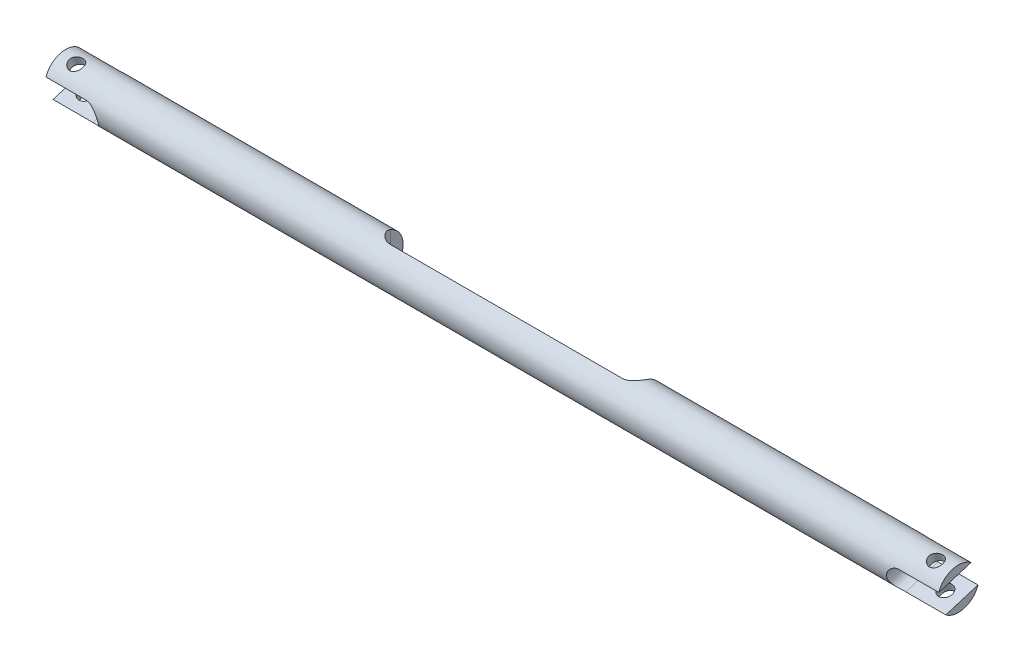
ISO-10303-21;
HEADER;
FILE_DESCRIPTION(('STEP AP214'),'2;1');
FILE_NAME('part.step','',(''),(''),'','','');
FILE_SCHEMA(('AUTOMOTIVE_DESIGN { 1 0 10303 214 1 1 1 1 }'));
ENDSEC;
DATA;
#1=APPLICATION_CONTEXT('core data for automotive mechanical design processes');
#2=APPLICATION_PROTOCOL_DEFINITION('international standard','automotive_design',2000,#1);
#3=PRODUCT_CONTEXT('',#1,'mechanical');
#4=PRODUCT('Part','Part','',(#3));
#5=PRODUCT_RELATED_PRODUCT_CATEGORY('part','',(#4));
#6=PRODUCT_DEFINITION_FORMATION('','',#4);
#7=PRODUCT_DEFINITION_CONTEXT('part definition',#1,'design');
#8=PRODUCT_DEFINITION('design','',#6,#7);
#9=PRODUCT_DEFINITION_SHAPE('','',#8);
#10=(LENGTH_UNIT() NAMED_UNIT(*) SI_UNIT(.MILLI.,.METRE.));
#11=(NAMED_UNIT(*) PLANE_ANGLE_UNIT() SI_UNIT($,.RADIAN.));
#12=(NAMED_UNIT(*) SI_UNIT($,.STERADIAN.) SOLID_ANGLE_UNIT());
#13=UNCERTAINTY_MEASURE_WITH_UNIT(LENGTH_MEASURE(1.E-05),#10,'distance_accuracy_value','');
#14=(GEOMETRIC_REPRESENTATION_CONTEXT(3) GLOBAL_UNCERTAINTY_ASSIGNED_CONTEXT((#13)) GLOBAL_UNIT_ASSIGNED_CONTEXT((#10,
#11,#12)) REPRESENTATION_CONTEXT('',''));
#15=CARTESIAN_POINT('',(0.,0.,0.));
#16=DIRECTION('',(0.,0.,1.));
#17=DIRECTION('',(1.,0.,0.));
#18=AXIS2_PLACEMENT_3D('',#15,#16,#17);
#19=CARTESIAN_POINT('',(-205.74,0.,0.));
#20=DIRECTION('',(1.,0.,0.));
#21=DIRECTION('',(0.,0.,-1.));
#22=AXIS2_PLACEMENT_3D('',#19,#20,#21);
#23=PLANE('',#22);
#24=CARTESIAN_POINT('',(-205.74,0.,0.));
#25=DIRECTION('',(1.,0.,0.));
#26=DIRECTION('',(0.,0.,-1.));
#27=AXIS2_PLACEMENT_3D('',#24,#25,#26);
#28=CIRCLE('',#27,9.525);
#29=CARTESIAN_POINT('',(-205.74,7.55168256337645,-5.80497333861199));
#30=VERTEX_POINT('',#29);
#31=CARTESIAN_POINT('',(-205.74,3.01452868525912,9.03538830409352));
#32=VERTEX_POINT('',#31);
#33=EDGE_CURVE('E149',#30,#32,#28,.T.);
#34=ORIENTED_EDGE('',*,*,#33,.F.);
#35=DIRECTION('',(0.,-0.292371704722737,0.956304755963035));
#36=VECTOR('',#35,1.);
#37=CARTESIAN_POINT('',(-205.74,5.28310562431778,1.61520748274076));
#38=LINE('',#37,#36);
#39=EDGE_CURVE('E153',#30,#32,#38,.T.);
#40=ORIENTED_EDGE('',*,*,#39,.T.);
#41=EDGE_LOOP('',(#34,#40));
#42=FACE_BOUND('',#41,.T.);
#43=ADVANCED_FACE('F34',(#42),#23,.F.);
#44=CARTESIAN_POINT('',(-198.12,11.3739476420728,3.47736476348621));
#45=DIRECTION('',(0.,-0.956304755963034,-0.292371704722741));
#46=DIRECTION('',(0.,0.292371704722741,-0.956304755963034));
#47=AXIS2_PLACEMENT_3D('',#44,#45,#46);
#48=CYLINDRICAL_SURFACE('',#47,3.17499999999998);
#49=CARTESIAN_POINT('',(-198.12,5.28310562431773,1.61520748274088));
#50=DIRECTION('',(0.,0.956304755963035,0.292371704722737));
#51=DIRECTION('',(0.,-0.292371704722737,0.956304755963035));
#52=AXIS2_PLACEMENT_3D('',#49,#50,#51);
#53=CIRCLE('',#52,3.17499999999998);
#54=CARTESIAN_POINT('',(-198.12,4.35482546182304,4.6514750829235));
#55=VERTEX_POINT('',#54);
#56=EDGE_CURVE('E135',#55,#55,#53,.F.);
#57=ORIENTED_EDGE('',*,*,#56,.T.);
#58=EDGE_LOOP('',(#57));
#59=FACE_BOUND('',#58,.T.);
#60=CARTESIAN_POINT('',(-198.12,9.51614180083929,-0.410694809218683));
#61=CARTESIAN_POINT('',(-197.947063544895,9.51614149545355,-0.410695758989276));
#62=CARTESIAN_POINT('',(-197.77413201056,9.51682621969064,-0.395660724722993));
#63=CARTESIAN_POINT('',(-197.433392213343,9.51910831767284,-0.336252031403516));
#64=CARTESIAN_POINT('',(-197.265584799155,9.52070584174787,-0.291873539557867));
#65=CARTESIAN_POINT('',(-196.940084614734,9.52355076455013,-0.175876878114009));
#66=CARTESIAN_POINT('',(-196.782372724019,9.52479884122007,-0.104312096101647));
#67=CARTESIAN_POINT('',(-196.48055684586,9.52515702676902,0.0633069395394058));
#68=CARTESIAN_POINT('',(-196.336455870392,9.5242666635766,0.159366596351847));
#69=CARTESIAN_POINT('',(-196.060314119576,9.51819199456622,0.376619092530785));
#70=CARTESIAN_POINT('',(-195.928883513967,9.51285629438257,0.498583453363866));
#71=CARTESIAN_POINT('',(-195.687293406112,9.49541429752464,0.761634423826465));
#72=CARTESIAN_POINT('',(-195.577137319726,9.48330691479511,0.902724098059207));
#73=CARTESIAN_POINT('',(-195.378454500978,9.44986352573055,1.20383004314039));
#74=CARTESIAN_POINT('',(-195.290567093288,9.42829497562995,1.36424408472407));
#75=CARTESIAN_POINT('',(-195.14314671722,9.37430893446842,1.69591706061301));
#76=CARTESIAN_POINT('',(-195.083606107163,9.34189437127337,1.86717305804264));
#77=CARTESIAN_POINT('',(-194.996638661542,9.26692230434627,2.2089133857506));
#78=CARTESIAN_POINT('',(-194.968166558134,9.22475694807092,2.37921724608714));
#79=CARTESIAN_POINT('',(-194.94082076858,9.13026856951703,2.71936473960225));
#80=CARTESIAN_POINT('',(-194.941939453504,9.0779481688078,2.88920848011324));
#81=CARTESIAN_POINT('',(-194.973080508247,8.96703722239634,3.21661227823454));
#82=CARTESIAN_POINT('',(-195.001967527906,8.90877308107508,3.37439284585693));
#83=CARTESIAN_POINT('',(-195.085947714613,8.78671743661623,3.68054268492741));
#84=CARTESIAN_POINT('',(-195.141042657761,8.72292555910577,3.82891131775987));
#85=CARTESIAN_POINT('',(-195.276537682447,8.59185620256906,4.11469223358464));
#86=CARTESIAN_POINT('',(-195.357260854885,8.52454392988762,4.2519348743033));
#87=CARTESIAN_POINT('',(-195.541454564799,8.39057032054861,4.51056533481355));
#88=CARTESIAN_POINT('',(-195.644931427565,8.32390917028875,4.63194873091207));
#89=CARTESIAN_POINT('',(-195.877416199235,8.1917355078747,4.86205040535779));
#90=CARTESIAN_POINT('',(-196.007396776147,8.12642484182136,4.96990332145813));
#91=CARTESIAN_POINT('',(-196.286274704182,8.00451497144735,5.16396468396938));
#92=CARTESIAN_POINT('',(-196.435174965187,7.94791711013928,5.25016979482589));
#93=CARTESIAN_POINT('',(-196.750475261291,7.84671304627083,5.40028375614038));
#94=CARTESIAN_POINT('',(-196.917094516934,7.80228930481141,5.46385722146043));
#95=CARTESIAN_POINT('',(-197.261389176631,7.73020563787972,5.56538122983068));
#96=CARTESIAN_POINT('',(-197.43905991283,7.70253868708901,5.60334251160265));
#97=CARTESIAN_POINT('',(-197.791826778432,7.66730225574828,5.65145605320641));
#98=CARTESIAN_POINT('',(-197.966677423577,7.65888237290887,5.66278567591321));
#99=CARTESIAN_POINT('',(-198.316139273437,7.66037158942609,5.6607719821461));
#100=CARTESIAN_POINT('',(-198.490750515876,7.67027735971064,5.64743314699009));
#101=CARTESIAN_POINT('',(-198.828523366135,7.70687924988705,5.59736823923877));
#102=CARTESIAN_POINT('',(-198.991872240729,7.73298691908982,5.56146127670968));
#103=CARTESIAN_POINT('',(-199.309175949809,7.79941001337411,5.46791520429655));
#104=CARTESIAN_POINT('',(-199.463129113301,7.83972795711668,5.4102722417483));
#105=CARTESIAN_POINT('',(-199.762682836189,7.93319812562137,5.27229804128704));
#106=CARTESIAN_POINT('',(-199.907863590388,7.98671686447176,5.19130517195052));
#107=CARTESIAN_POINT('',(-200.181038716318,8.10231610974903,5.00896531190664));
#108=CARTESIAN_POINT('',(-200.309028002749,8.16439913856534,4.90761232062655));
#109=CARTESIAN_POINT('',(-200.550551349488,8.29654497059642,4.68091488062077));
#110=CARTESIAN_POINT('',(-200.66309368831,8.36684798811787,4.55465077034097));
#111=CARTESIAN_POINT('',(-200.862933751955,8.50858086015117,4.28403698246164));
#112=CARTESIAN_POINT('',(-200.950232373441,8.58001067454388,4.13968794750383));
#113=CARTESIAN_POINT('',(-201.096308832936,8.71951816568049,3.8370785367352));
#114=CARTESIAN_POINT('',(-201.155272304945,8.78761496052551,3.67891695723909));
#115=CARTESIAN_POINT('',(-201.243335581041,8.91742252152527,3.35202521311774));
#116=CARTESIAN_POINT('',(-201.272446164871,8.97913558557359,3.18329888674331));
#117=CARTESIAN_POINT('',(-201.299007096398,9.09075141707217,2.8484300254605));
#118=CARTESIAN_POINT('',(-201.297881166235,9.14107294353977,2.68253876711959));
#119=CARTESIAN_POINT('',(-201.267513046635,9.23198327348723,2.35068139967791));
#120=CARTESIAN_POINT('',(-201.238273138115,9.27257286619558,2.18471529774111));
#121=CARTESIAN_POINT('',(-201.153451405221,9.34302422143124,1.8602879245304));
#122=CARTESIAN_POINT('',(-201.098295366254,9.37304614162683,1.70174932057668));
#123=CARTESIAN_POINT('',(-200.963601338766,9.42376192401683,1.39381307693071));
#124=CARTESIAN_POINT('',(-200.884058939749,9.44445409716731,1.24441709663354));
#125=CARTESIAN_POINT('',(-200.699466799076,9.47833167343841,0.953470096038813));
#126=CARTESIAN_POINT('',(-200.593583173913,9.49121145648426,0.812412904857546));
#127=CARTESIAN_POINT('',(-200.360732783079,9.51012544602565,0.548357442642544));
#128=CARTESIAN_POINT('',(-200.233759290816,9.51615746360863,0.425364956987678));
#129=CARTESIAN_POINT('',(-199.956390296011,9.52368313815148,0.196721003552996));
#130=CARTESIAN_POINT('',(-199.805272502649,9.52498989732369,0.0919368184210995));
#131=CARTESIAN_POINT('',(-199.487363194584,9.52501003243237,-0.0903003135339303));
#132=CARTESIAN_POINT('',(-199.320575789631,9.52372408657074,-0.167760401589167));
#133=CARTESIAN_POINT('',(-198.98372120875,9.52079386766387,-0.289231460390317));
#134=CARTESIAN_POINT('',(-198.814143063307,9.51916841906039,-0.334596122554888));
#135=CARTESIAN_POINT('',(-198.469707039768,9.51684269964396,-0.395322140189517));
#136=CARTESIAN_POINT('',(-198.294851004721,9.51614210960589,-0.410693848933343));
#137=CARTESIAN_POINT('',(-198.12,9.51614180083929,-0.410694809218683));
#138=B_SPLINE_CURVE_WITH_KNOTS('',3,(#60,#61,#62,#63,#64,#65,#66,#67,#68,#69,#70,#71,#72,#73,
#74,#75,#76,#77,#78,#79,#80,#81,#82,#83,#84,#85,#86,#87,#88,#89,#90,#91,#92,#93,#94,#95,#96,#97,
#98,#99,#100,#101,#102,#103,#104,#105,#106,#107,#108,#109,#110,#111,#112,#113,#114,#115,#116,
#117,#118,#119,#120,#121,#122,#123,#124,#125,#126,#127,#128,#129,#130,#131,#132,#133,#134,#135,
#136,#137),.UNSPECIFIED.,.T.,.F.,(4,2,2,2,2,2,2,2,2,2,2,2,2,2,2,2,2,2,2,2,2,2,2,2,2,2,2,2,2,2,2,
2,2,2,2,2,2,2,4),(0.,0.518161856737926,1.03640907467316,1.55364379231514,2.07099270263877,
2.6067174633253,3.14252816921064,3.69231882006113,4.24196117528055,4.77247962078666,
5.30286129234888,5.81244090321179,6.32205505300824,6.8383675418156,7.35482374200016,
7.89559553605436,8.43645060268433,8.98501631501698,9.53335188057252,10.0569487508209,
10.5804505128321,11.0859695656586,11.5915782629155,12.1132237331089,12.6350231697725,
13.1819271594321,13.7288117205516,14.2720628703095,14.8151177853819,15.3326491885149,
15.8501386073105,16.3594083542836,16.8687702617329,17.39695274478,17.925304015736,
18.4743376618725,19.0232277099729,19.5473069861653,20.0712053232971),.UNSPECIFIED.);
#139=CARTESIAN_POINT('',(-198.12,9.51614180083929,-0.410694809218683));
#140=VERTEX_POINT('',#139);
#141=EDGE_CURVE('E274',#140,#140,#138,.T.);
#142=ORIENTED_EDGE('',*,*,#141,.F.);
#143=EDGE_LOOP('',(#142));
#144=FACE_BOUND('',#143,.T.);
#145=ADVANCED_FACE('F313',(#59,#144),#48,.F.);
#146=CARTESIAN_POINT('',(205.74,0.,0.));
#147=DIRECTION('',(1.,0.,0.));
#148=DIRECTION('',(0.,0.,-1.));
#149=AXIS2_PLACEMENT_3D('',#146,#147,#148);
#150=PLANE('',#149);
#151=DIRECTION('',(0.,-0.292371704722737,0.956304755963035));
#152=VECTOR('',#151,1.);
#153=CARTESIAN_POINT('',(205.74,5.28310562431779,1.61520748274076));
#154=LINE('',#153,#152);
#155=CARTESIAN_POINT('',(205.74,7.55168256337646,-5.80497333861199));
#156=VERTEX_POINT('',#155);
#157=CARTESIAN_POINT('',(205.74,3.01452868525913,9.03538830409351));
#158=VERTEX_POINT('',#157);
#159=EDGE_CURVE('E172',#156,#158,#154,.T.);
#160=ORIENTED_EDGE('',*,*,#159,.F.);
#161=CARTESIAN_POINT('',(205.74,0.,0.));
#162=DIRECTION('',(1.,0.,0.));
#163=DIRECTION('',(0.,0.,-1.));
#164=AXIS2_PLACEMENT_3D('',#161,#162,#163);
#165=CIRCLE('',#164,9.525);
#166=EDGE_CURVE('E195',#156,#158,#165,.T.);
#167=ORIENTED_EDGE('',*,*,#166,.T.);
#168=EDGE_LOOP('',(#160,#167));
#169=FACE_BOUND('',#168,.T.);
#170=ADVANCED_FACE('F319',(#169),#150,.T.);
#171=CARTESIAN_POINT('',(198.12,11.3739476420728,3.4773647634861));
#172=DIRECTION('',(0.,-0.956304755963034,-0.292371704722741));
#173=DIRECTION('',(0.,0.292371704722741,-0.956304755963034));
#174=AXIS2_PLACEMENT_3D('',#171,#172,#173);
#175=CYLINDRICAL_SURFACE('',#174,3.175);
#176=CARTESIAN_POINT('',(198.12,5.28310562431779,1.61520748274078));
#177=DIRECTION('',(0.,0.956304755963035,0.292371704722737));
#178=DIRECTION('',(0.,-0.292371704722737,0.956304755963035));
#179=AXIS2_PLACEMENT_3D('',#176,#177,#178);
#180=CIRCLE('',#179,3.175);
#181=CARTESIAN_POINT('',(198.12,4.3548254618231,4.65147508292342));
#182=VERTEX_POINT('',#181);
#183=EDGE_CURVE('E171',#182,#182,#180,.F.);
#184=ORIENTED_EDGE('',*,*,#183,.T.);
#185=EDGE_LOOP('',(#184));
#186=FACE_BOUND('',#185,.T.);
#187=CARTESIAN_POINT('',(198.12,9.51614180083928,-0.410694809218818));
#188=CARTESIAN_POINT('',(198.292936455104,9.51614149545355,-0.410695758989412));
#189=CARTESIAN_POINT('',(198.46586798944,9.51682621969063,-0.395660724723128));
#190=CARTESIAN_POINT('',(198.806607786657,9.51910831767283,-0.336252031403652));
#191=CARTESIAN_POINT('',(198.974415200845,9.52070584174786,-0.291873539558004));
#192=CARTESIAN_POINT('',(199.299915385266,9.52355076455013,-0.175876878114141));
#193=CARTESIAN_POINT('',(199.457627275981,9.52479884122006,-0.104312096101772));
#194=CARTESIAN_POINT('',(199.75944315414,9.52515702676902,0.0633069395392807));
#195=CARTESIAN_POINT('',(199.903544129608,9.5242666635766,0.159366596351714));
#196=CARTESIAN_POINT('',(200.179685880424,9.51819199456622,0.376619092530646));
#197=CARTESIAN_POINT('',(200.311116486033,9.51285629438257,0.498583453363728));
#198=CARTESIAN_POINT('',(200.552706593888,9.49541429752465,0.761634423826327));
#199=CARTESIAN_POINT('',(200.662862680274,9.48330691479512,0.902724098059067));
#200=CARTESIAN_POINT('',(200.861545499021,9.44986352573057,1.20383004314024));
#201=CARTESIAN_POINT('',(200.949432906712,9.42829497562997,1.36424408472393));
#202=CARTESIAN_POINT('',(201.09685328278,9.37430893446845,1.69591706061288));
#203=CARTESIAN_POINT('',(201.156393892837,9.3418943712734,1.86717305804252));
#204=CARTESIAN_POINT('',(201.243361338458,9.2669223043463,2.20891338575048));
#205=CARTESIAN_POINT('',(201.271833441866,9.22475694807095,2.37921724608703));
#206=CARTESIAN_POINT('',(201.29917923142,9.13026856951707,2.71936473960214));
#207=CARTESIAN_POINT('',(201.298060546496,9.07794816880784,2.88920848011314));
#208=CARTESIAN_POINT('',(201.266919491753,8.96703722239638,3.21661227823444));
#209=CARTESIAN_POINT('',(201.238032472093,8.90877308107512,3.37439284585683));
#210=CARTESIAN_POINT('',(201.154052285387,8.78671743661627,3.68054268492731));
#211=CARTESIAN_POINT('',(201.098957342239,8.72292555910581,3.82891131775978));
#212=CARTESIAN_POINT('',(200.963462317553,8.5918562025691,4.11469223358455));
#213=CARTESIAN_POINT('',(200.882739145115,8.52454392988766,4.25193487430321));
#214=CARTESIAN_POINT('',(200.6985454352,8.39057032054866,4.51056533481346));
#215=CARTESIAN_POINT('',(200.595068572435,8.3239091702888,4.63194873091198));
#216=CARTESIAN_POINT('',(200.362583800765,8.19173550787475,4.8620504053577));
#217=CARTESIAN_POINT('',(200.232603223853,8.12642484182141,4.96990332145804));
#218=CARTESIAN_POINT('',(199.953725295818,8.0045149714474,5.1639646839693));
#219=CARTESIAN_POINT('',(199.804825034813,7.94791711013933,5.25016979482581));
#220=CARTESIAN_POINT('',(199.489524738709,7.84671304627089,5.4002837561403));
#221=CARTESIAN_POINT('',(199.322905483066,7.80228930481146,5.46385722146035));
#222=CARTESIAN_POINT('',(198.978610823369,7.73020563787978,5.5653812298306));
#223=CARTESIAN_POINT('',(198.80094008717,7.70253868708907,5.60334251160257));
#224=CARTESIAN_POINT('',(198.448173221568,7.66730225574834,5.65145605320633));
#225=CARTESIAN_POINT('',(198.273322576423,7.65888237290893,5.66278567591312));
#226=CARTESIAN_POINT('',(197.923860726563,7.66037158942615,5.66077198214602));
#227=CARTESIAN_POINT('',(197.749249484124,7.6702773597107,5.64743314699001));
#228=CARTESIAN_POINT('',(197.411476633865,7.70687924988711,5.59736823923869));
#229=CARTESIAN_POINT('',(197.248127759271,7.73298691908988,5.56146127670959));
#230=CARTESIAN_POINT('',(196.930824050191,7.79941001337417,5.46791520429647));
#231=CARTESIAN_POINT('',(196.776870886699,7.83972795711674,5.41027224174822));
#232=CARTESIAN_POINT('',(196.477317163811,7.93319812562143,5.27229804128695));
#233=CARTESIAN_POINT('',(196.332136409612,7.98671686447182,5.19130517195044));
#234=CARTESIAN_POINT('',(196.058961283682,8.10231610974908,5.00896531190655));
#235=CARTESIAN_POINT('',(195.930971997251,8.16439913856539,4.90761232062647));
#236=CARTESIAN_POINT('',(195.689448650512,8.29654497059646,4.68091488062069));
#237=CARTESIAN_POINT('',(195.57690631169,8.36684798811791,4.55465077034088));
#238=CARTESIAN_POINT('',(195.377066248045,8.50858086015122,4.28403698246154));
#239=CARTESIAN_POINT('',(195.289767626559,8.58001067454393,4.13968794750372));
#240=CARTESIAN_POINT('',(195.143691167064,8.71951816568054,3.83707853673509));
#241=CARTESIAN_POINT('',(195.084727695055,8.78761496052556,3.67891695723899));
#242=CARTESIAN_POINT('',(194.996664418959,8.91742252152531,3.35202521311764));
#243=CARTESIAN_POINT('',(194.967553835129,8.97913558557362,3.18329888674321));
#244=CARTESIAN_POINT('',(194.940992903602,9.0907514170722,2.84843002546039));
#245=CARTESIAN_POINT('',(194.942118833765,9.14107294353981,2.68253876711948));
#246=CARTESIAN_POINT('',(194.972486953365,9.23198327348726,2.3506813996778));
#247=CARTESIAN_POINT('',(195.001726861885,9.2725728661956,2.184715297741));
#248=CARTESIAN_POINT('',(195.086548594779,9.34302422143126,1.86028792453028));
#249=CARTESIAN_POINT('',(195.141704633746,9.37304614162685,1.70174932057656));
#250=CARTESIAN_POINT('',(195.276398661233,9.42376192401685,1.3938130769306));
#251=CARTESIAN_POINT('',(195.355941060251,9.44445409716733,1.24441709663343));
#252=CARTESIAN_POINT('',(195.540533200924,9.47833167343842,0.953470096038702));
#253=CARTESIAN_POINT('',(195.646416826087,9.49121145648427,0.812412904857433));
#254=CARTESIAN_POINT('',(195.879267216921,9.51012544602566,0.548357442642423));
#255=CARTESIAN_POINT('',(196.006240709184,9.51615746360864,0.42536495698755));
#256=CARTESIAN_POINT('',(196.283609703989,9.52368313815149,0.196721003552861));
#257=CARTESIAN_POINT('',(196.434727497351,9.52498989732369,0.0919368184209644));
#258=CARTESIAN_POINT('',(196.752636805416,9.52501003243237,-0.0903003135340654));
#259=CARTESIAN_POINT('',(196.919424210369,9.52372408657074,-0.167760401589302));
#260=CARTESIAN_POINT('',(197.25627879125,9.52079386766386,-0.289231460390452));
#261=CARTESIAN_POINT('',(197.425856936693,9.51916841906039,-0.334596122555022));
#262=CARTESIAN_POINT('',(197.770292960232,9.51684269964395,-0.395322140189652));
#263=CARTESIAN_POINT('',(197.945148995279,9.51614210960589,-0.410693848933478));
#264=CARTESIAN_POINT('',(198.12,9.51614180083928,-0.410694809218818));
#265=B_SPLINE_CURVE_WITH_KNOTS('',3,(#187,#188,#189,#190,#191,#192,#193,#194,#195,#196,#197,
#198,#199,#200,#201,#202,#203,#204,#205,#206,#207,#208,#209,#210,#211,#212,#213,#214,#215,#216,
#217,#218,#219,#220,#221,#222,#223,#224,#225,#226,#227,#228,#229,#230,#231,#232,#233,#234,#235,
#236,#237,#238,#239,#240,#241,#242,#243,#244,#245,#246,#247,#248,#249,#250,#251,#252,#253,#254,
#255,#256,#257,#258,#259,#260,#261,#262,#263,#264),.UNSPECIFIED.,.T.,.F.,(4,2,2,2,2,2,2,2,2,2,2,
2,2,2,2,2,2,2,2,2,2,2,2,2,2,2,2,2,2,2,2,2,2,2,2,2,2,2,4),(0.,0.518161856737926,1.03640907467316,
1.55364379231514,2.07099270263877,2.6067174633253,3.14252816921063,3.69231882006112,
4.24196117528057,4.77247962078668,5.30286129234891,5.81244090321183,6.32205505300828,
6.83836754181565,7.35482374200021,7.89559553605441,8.43645060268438,8.98501631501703,
9.53335188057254,10.0569487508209,10.5804505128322,11.0859695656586,11.5915782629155,
12.113223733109,12.6350231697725,13.1819271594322,13.7288117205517,14.2720628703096,
14.815117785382,15.3326491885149,15.8501386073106,16.3594083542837,16.868770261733,
17.3969527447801,17.9253040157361,18.4743376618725,19.023227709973,19.5473069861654,
20.0712053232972),.UNSPECIFIED.);
#266=CARTESIAN_POINT('',(198.12,9.51614180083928,-0.410694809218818));
#267=VERTEX_POINT('',#266);
#268=EDGE_CURVE('E194',#267,#267,#265,.T.);
#269=ORIENTED_EDGE('',*,*,#268,.F.);
#270=EDGE_LOOP('',(#269));
#271=FACE_BOUND('',#270,.T.);
#272=ADVANCED_FACE('F257',(#186,#271),#175,.F.);
#273=CARTESIAN_POINT('',(205.74,0.,0.));
#274=DIRECTION('',(-1.,0.,0.));
#275=DIRECTION('',(0.,0.,1.));
#276=AXIS2_PLACEMENT_3D('',#273,#274,#275);
#277=CYLINDRICAL_SURFACE('',#276,9.525);
#278=ORIENTED_EDGE('',*,*,#141,.T.);
#279=EDGE_LOOP('',(#278));
#280=FACE_BOUND('',#279,.T.);
#281=CARTESIAN_POINT('',(-198.12,-7.65958147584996,-5.66184039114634));
#282=CARTESIAN_POINT('',(-198.292936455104,-7.65958069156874,-5.66184100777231));
#283=CARTESIAN_POINT('',(-198.46586798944,-7.66855583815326,-5.64975929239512));
#284=CARTESIAN_POINT('',(-198.806607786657,-7.70366870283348,-5.60178338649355));
#285=CARTESIAN_POINT('',(-198.974415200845,-7.72980924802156,-5.56588527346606));
#286=CARTESIAN_POINT('',(-199.299915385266,-7.79703230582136,-5.4713105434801));
#287=CARTESIAN_POINT('',(-199.457627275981,-7.83808552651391,-5.41267856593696));
#288=CARTESIAN_POINT('',(-199.75944315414,-7.93211385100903,-5.27391638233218));
#289=CARTESIAN_POINT('',(-199.903544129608,-7.98509158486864,-5.19378143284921));
#290=CARTESIAN_POINT('',(-200.179685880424,-8.10154151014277,-5.01027403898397));
#291=CARTESIAN_POINT('',(-200.311116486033,-8.16531961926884,-4.90617731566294));
#292=CARTESIAN_POINT('',(-200.552706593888,-8.29795578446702,-4.67834473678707));
#293=CARTESIAN_POINT('',(-200.662862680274,-8.36681465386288,-4.55460573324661));
#294=CARTESIAN_POINT('',(-200.861545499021,-8.50746513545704,-4.28627628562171));
#295=CARTESIAN_POINT('',(-200.949432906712,-8.57928639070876,-4.14122603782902));
#296=CARTESIAN_POINT('',(-201.09685328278,-8.71999910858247,-3.83606806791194));
#297=CARTESIAN_POINT('',(-201.156393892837,-8.78889135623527,-3.67596441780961));
#298=CARTESIAN_POINT('',(-201.243361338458,-8.91783546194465,-3.35072499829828));
#299=CARTESIAN_POINT('',(-201.271833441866,-8.97811150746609,-3.18595813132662));
#300=CARTESIAN_POINT('',(-201.29917923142,-9.08998515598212,-2.85112584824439));
#301=CARTESIAN_POINT('',(-201.298060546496,-9.14158499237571,-2.68106180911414));
#302=CARTESIAN_POINT('',(-201.266919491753,-9.23271753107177,-2.34761114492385));
#303=CARTESIAN_POINT('',(-201.238032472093,-9.27264414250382,-2.18422423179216));
#304=CARTESIAN_POINT('',(-201.154052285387,-9.34265224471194,-1.86216186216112));
#305=CARTESIAN_POINT('',(-201.098957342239,-9.37273306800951,-1.70348672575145));
#306=CARTESIAN_POINT('',(-200.963462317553,-9.42387830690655,-1.39327055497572));
#307=CARTESIAN_POINT('',(-200.882739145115,-9.44481901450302,-1.24185070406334));
#308=CARTESIAN_POINT('',(-200.6985454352,-9.47837417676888,-0.952519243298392));
#309=CARTESIAN_POINT('',(-200.595068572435,-9.49098631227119,-0.814611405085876));
#310=CARTESIAN_POINT('',(-200.362583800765,-9.51008060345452,-0.549937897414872));
#311=CARTESIAN_POINT('',(-200.232603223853,-9.51624619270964,-0.424002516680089));
#312=CARTESIAN_POINT('',(-199.953725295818,-9.52369606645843,-0.194947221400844));
#313=CARTESIAN_POINT('',(-199.804825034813,-9.52497959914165,-0.0918308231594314));
#314=CARTESIAN_POINT('',(-199.489524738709,-9.5250202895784,0.0892118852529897));
#315=CARTESIAN_POINT('',(-199.322905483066,-9.52374116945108,0.166758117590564));
#316=CARTESIAN_POINT('',(-198.978610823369,-9.52075260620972,0.291234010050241));
#317=CARTESIAN_POINT('',(-198.80094008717,-9.51904334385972,0.338176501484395));
#318=CARTESIAN_POINT('',(-198.448173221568,-9.51673576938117,0.39776839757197));
#319=CARTESIAN_POINT('',(-198.273322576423,-9.51609081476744,0.41186941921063));
#320=CARTESIAN_POINT('',(-197.923860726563,-9.51619938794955,0.40936723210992));
#321=CARTESIAN_POINT('',(-197.749249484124,-9.51695266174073,0.392769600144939));
#322=CARTESIAN_POINT('',(-197.411476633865,-9.51930106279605,0.330796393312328));
#323=CARTESIAN_POINT('',(-197.248127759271,-9.52086638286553,0.286428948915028));
#324=CARTESIAN_POINT('',(-196.930824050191,-9.52362332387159,0.171732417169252));
#325=CARTESIAN_POINT('',(-196.776870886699,-9.52481487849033,0.101398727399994));
#326=CARTESIAN_POINT('',(-196.477317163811,-9.52515096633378,-0.0652549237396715));
#327=CARTESIAN_POINT('',(-196.332136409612,-9.5242293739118,-0.162328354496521));
#328=CARTESIAN_POINT('',(-196.058961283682,-9.51810233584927,-0.37813722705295));
#329=CARTESIAN_POINT('',(-195.930971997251,-9.51289562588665,-0.496879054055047));
#330=CARTESIAN_POINT('',(-195.689448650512,-9.49568188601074,-0.758714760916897));
#331=CARTESIAN_POINT('',(-195.57690631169,-9.4833597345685,-0.902705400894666));
#332=CARTESIAN_POINT('',(-195.377066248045,-9.44953630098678,-1.20631041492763));
#333=CARTESIAN_POINT('',(-195.289767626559,-9.42803534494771,-1.36592423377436));
#334=CARTESIAN_POINT('',(-195.143691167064,-9.37447526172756,-1.6948104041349));
#335=CARTESIAN_POINT('',(-195.084727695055,-9.34248723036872,-1.86401154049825));
#336=CARTESIAN_POINT('',(-194.996664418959,-9.26730703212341,-2.20760454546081));
#337=CARTESIAN_POINT('',(-194.967553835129,-9.22411891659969,-2.38199451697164));
#338=CARTESIAN_POINT('',(-194.940992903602,-9.12939634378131,-2.7220281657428));
#339=CARTESIAN_POINT('',(-194.942118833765,-9.0783495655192,-2.88769769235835));
#340=CARTESIAN_POINT('',(-194.972486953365,-8.96814535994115,-3.2136563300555));
#341=CARTESIAN_POINT('',(-195.001726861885,-8.90898859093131,-3.37394587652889));
#342=CARTESIAN_POINT('',(-195.086548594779,-8.785977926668,-3.68230425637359));
#343=CARTESIAN_POINT('',(-195.141704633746,-8.72221356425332,-3.83052676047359));
#344=CARTESIAN_POINT('',(-195.276398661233,-8.59206309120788,-4.11417738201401));
#345=CARTESIAN_POINT('',(-195.355941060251,-8.52567650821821,-4.2496031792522));
#346=CARTESIAN_POINT('',(-195.540533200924,-8.39106679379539,-4.50975327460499));
#347=CARTESIAN_POINT('',(-195.646416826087,-8.32286643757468,-4.63389726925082));
#348=CARTESIAN_POINT('',(-195.879267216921,-8.19088890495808,-4.86338573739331));
#349=CARTESIAN_POINT('',(-196.006240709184,-8.12711314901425,-4.96872419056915));
#350=CARTESIAN_POINT('',(-196.283609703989,-8.00549613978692,-5.16248692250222));
#351=CARTESIAN_POINT('',(-196.434727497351,-7.94798491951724,-5.25008767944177));
#352=CARTESIAN_POINT('',(-196.752636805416,-7.84609590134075,-5.40118036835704));
#353=CARTESIAN_POINT('',(-196.919424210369,-7.80171467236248,-5.46467859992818));
#354=CARTESIAN_POINT('',(-197.25627879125,-7.73135965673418,-5.56374411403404));
#355=CARTESIAN_POINT('',(-197.425856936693,-7.70464450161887,-5.60044418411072));
#356=CARTESIAN_POINT('',(-197.770292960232,-7.6687588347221,-5.64948780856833));
#357=CARTESIAN_POINT('',(-197.945148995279,-7.65958226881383,-5.66183976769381));
#358=CARTESIAN_POINT('',(-198.12,-7.65958147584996,-5.66184039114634));
#359=B_SPLINE_CURVE_WITH_KNOTS('',3,(#281,#282,#283,#284,#285,#286,#287,#288,#289,#290,#291,
#292,#293,#294,#295,#296,#297,#298,#299,#300,#301,#302,#303,#304,#305,#306,#307,#308,#309,#310,
#311,#312,#313,#314,#315,#316,#317,#318,#319,#320,#321,#322,#323,#324,#325,#326,#327,#328,#329,
#330,#331,#332,#333,#334,#335,#336,#337,#338,#339,#340,#341,#342,#343,#344,#345,#346,#347,#348,
#349,#350,#351,#352,#353,#354,#355,#356,#357,#358),.UNSPECIFIED.,.T.,.F.,(4,2,2,2,2,2,2,2,2,2,2,
2,2,2,2,2,2,2,2,2,2,2,2,2,2,2,2,2,2,2,2,2,2,2,2,2,2,2,4),(0.,0.518161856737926,1.03640907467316,
1.55364379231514,2.07099270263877,2.6067174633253,3.14252816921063,3.69231882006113,
4.24196117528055,4.77247962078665,5.30286129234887,5.81244090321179,6.32205505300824,
6.8383675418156,7.35482374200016,7.89559553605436,8.43645060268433,8.98501631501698,
9.53335188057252,10.0569487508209,10.5804505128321,11.0859695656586,11.5915782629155,
12.1132237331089,12.6350231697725,13.1819271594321,13.7288117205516,14.2720628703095,
14.8151177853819,15.3326491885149,15.8501386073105,16.3594083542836,16.8687702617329,
17.39695274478,17.925304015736,18.4743376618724,19.0232277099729,19.5473069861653,
20.0712053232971),.UNSPECIFIED.);
#360=CARTESIAN_POINT('',(-198.12,-7.65958147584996,-5.66184039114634));
#361=VERTEX_POINT('',#360);
#362=EDGE_CURVE('E180',#361,#361,#359,.T.);
#363=ORIENTED_EDGE('',*,*,#362,.T.);
#364=EDGE_LOOP('',(#363));
#365=FACE_BOUND('',#364,.T.);
#366=ORIENTED_EDGE('',*,*,#268,.T.);
#367=EDGE_LOOP('',(#366));
#368=FACE_BOUND('',#367,.T.);
#369=CARTESIAN_POINT('',(198.12,-7.65958147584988,-5.66184039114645));
#370=CARTESIAN_POINT('',(197.947063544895,-7.65958069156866,-5.66184100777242));
#371=CARTESIAN_POINT('',(197.77413201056,-7.66855583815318,-5.64975929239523));
#372=CARTESIAN_POINT('',(197.433392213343,-7.7036687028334,-5.60178338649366));
#373=CARTESIAN_POINT('',(197.265584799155,-7.72980924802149,-5.56588527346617));
#374=CARTESIAN_POINT('',(196.940084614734,-7.79703230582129,-5.47131054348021));
#375=CARTESIAN_POINT('',(196.782372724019,-7.83808552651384,-5.41267856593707));
#376=CARTESIAN_POINT('',(196.48055684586,-7.93211385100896,-5.2739163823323));
#377=CARTESIAN_POINT('',(196.336455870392,-7.98509158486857,-5.19378143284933));
#378=CARTESIAN_POINT('',(196.060314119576,-8.1015415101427,-5.01027403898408));
#379=CARTESIAN_POINT('',(195.928883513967,-8.16531961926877,-4.90617731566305));
#380=CARTESIAN_POINT('',(195.687293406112,-8.29795578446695,-4.67834473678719));
#381=CARTESIAN_POINT('',(195.577137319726,-8.36681465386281,-4.55460573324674));
#382=CARTESIAN_POINT('',(195.378454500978,-8.50746513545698,-4.28627628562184));
#383=CARTESIAN_POINT('',(195.290567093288,-8.57928639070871,-4.14122603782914));
#384=CARTESIAN_POINT('',(195.14314671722,-8.71999910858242,-3.83606806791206));
#385=CARTESIAN_POINT('',(195.083606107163,-8.78889135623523,-3.67596441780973));
#386=CARTESIAN_POINT('',(194.996638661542,-8.91783546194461,-3.35072499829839));
#387=CARTESIAN_POINT('',(194.968166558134,-8.97811150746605,-3.18595813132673));
#388=CARTESIAN_POINT('',(194.94082076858,-9.08998515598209,-2.8511258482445));
#389=CARTESIAN_POINT('',(194.941939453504,-9.14158499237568,-2.68106180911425));
#390=CARTESIAN_POINT('',(194.973080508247,-9.23271753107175,-2.34761114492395));
#391=CARTESIAN_POINT('',(195.001967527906,-9.2726441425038,-2.18422423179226));
#392=CARTESIAN_POINT('',(195.085947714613,-9.34265224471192,-1.86216186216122));
#393=CARTESIAN_POINT('',(195.141042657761,-9.37273306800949,-1.70348672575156));
#394=CARTESIAN_POINT('',(195.276537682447,-9.42387830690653,-1.39327055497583));
#395=CARTESIAN_POINT('',(195.357260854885,-9.44481901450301,-1.24185070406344));
#396=CARTESIAN_POINT('',(195.541454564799,-9.47837417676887,-0.952519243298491));
#397=CARTESIAN_POINT('',(195.644931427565,-9.49098631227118,-0.814611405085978));
#398=CARTESIAN_POINT('',(195.877416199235,-9.51008060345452,-0.549937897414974));
#399=CARTESIAN_POINT('',(196.007396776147,-9.51624619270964,-0.424002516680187));
#400=CARTESIAN_POINT('',(196.286274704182,-9.52369606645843,-0.194947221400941));
#401=CARTESIAN_POINT('',(196.435174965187,-9.52497959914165,-0.0918308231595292));
#402=CARTESIAN_POINT('',(196.750475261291,-9.5250202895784,0.0892118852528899));
#403=CARTESIAN_POINT('',(196.917094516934,-9.52374116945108,0.166758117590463));
#404=CARTESIAN_POINT('',(197.261389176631,-9.52075260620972,0.291234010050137));
#405=CARTESIAN_POINT('',(197.43905991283,-9.51904334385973,0.33817650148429));
#406=CARTESIAN_POINT('',(197.791826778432,-9.51673576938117,0.397768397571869));
#407=CARTESIAN_POINT('',(197.966677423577,-9.51609081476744,0.41186941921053));
#408=CARTESIAN_POINT('',(198.316139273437,-9.51619938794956,0.409367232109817));
#409=CARTESIAN_POINT('',(198.490750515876,-9.51695266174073,0.392769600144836));
#410=CARTESIAN_POINT('',(198.828523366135,-9.51930106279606,0.330796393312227));
#411=CARTESIAN_POINT('',(198.991872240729,-9.52086638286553,0.286428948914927));
#412=CARTESIAN_POINT('',(199.309175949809,-9.52362332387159,0.171732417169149));
#413=CARTESIAN_POINT('',(199.463129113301,-9.52481487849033,0.101398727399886));
#414=CARTESIAN_POINT('',(199.762682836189,-9.52515096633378,-0.0652549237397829));
#415=CARTESIAN_POINT('',(199.907863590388,-9.5242293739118,-0.162328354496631));
#416=CARTESIAN_POINT('',(200.181038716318,-9.51810233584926,-0.378137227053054));
#417=CARTESIAN_POINT('',(200.309028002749,-9.51289562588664,-0.496879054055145));
#418=CARTESIAN_POINT('',(200.550551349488,-9.49568188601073,-0.758714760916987));
#419=CARTESIAN_POINT('',(200.66309368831,-9.4833597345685,-0.902705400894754));
#420=CARTESIAN_POINT('',(200.862933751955,-9.44953630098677,-1.20631041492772));
#421=CARTESIAN_POINT('',(200.950232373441,-9.4280353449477,-1.36592423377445));
#422=CARTESIAN_POINT('',(201.096308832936,-9.37447526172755,-1.69481040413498));
#423=CARTESIAN_POINT('',(201.155272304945,-9.3424872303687,-1.86401154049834));
#424=CARTESIAN_POINT('',(201.243335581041,-9.26730703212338,-2.2076045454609));
#425=CARTESIAN_POINT('',(201.272446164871,-9.22411891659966,-2.38199451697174));
#426=CARTESIAN_POINT('',(201.299007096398,-9.12939634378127,-2.72202816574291));
#427=CARTESIAN_POINT('',(201.297881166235,-9.07834956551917,-2.88769769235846));
#428=CARTESIAN_POINT('',(201.267513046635,-8.96814535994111,-3.21365633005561));
#429=CARTESIAN_POINT('',(201.238273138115,-8.90898859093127,-3.37394587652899));
#430=CARTESIAN_POINT('',(201.153451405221,-8.78597792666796,-3.68230425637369));
#431=CARTESIAN_POINT('',(201.098295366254,-8.72221356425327,-3.83052676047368));
#432=CARTESIAN_POINT('',(200.963601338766,-8.59206309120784,-4.11417738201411));
#433=CARTESIAN_POINT('',(200.884058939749,-8.52567650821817,-4.24960317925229));
#434=CARTESIAN_POINT('',(200.699466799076,-8.39106679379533,-4.5097532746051));
#435=CARTESIAN_POINT('',(200.593583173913,-8.32286643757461,-4.63389726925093));
#436=CARTESIAN_POINT('',(200.360732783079,-8.19088890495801,-4.86338573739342));
#437=CARTESIAN_POINT('',(200.233759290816,-8.12711314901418,-4.96872419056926));
#438=CARTESIAN_POINT('',(199.956390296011,-8.00549613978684,-5.16248692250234));
#439=CARTESIAN_POINT('',(199.805272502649,-7.94798491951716,-5.2500876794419));
#440=CARTESIAN_POINT('',(199.487363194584,-7.84609590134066,-5.40118036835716));
#441=CARTESIAN_POINT('',(199.320575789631,-7.8017146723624,-5.4646785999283));
#442=CARTESIAN_POINT('',(198.98372120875,-7.73135965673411,-5.56374411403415));
#443=CARTESIAN_POINT('',(198.814143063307,-7.70464450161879,-5.60044418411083));
#444=CARTESIAN_POINT('',(198.469707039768,-7.66875883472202,-5.64948780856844));
#445=CARTESIAN_POINT('',(198.294851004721,-7.65958226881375,-5.66183976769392));
#446=CARTESIAN_POINT('',(198.12,-7.65958147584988,-5.66184039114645));
#447=B_SPLINE_CURVE_WITH_KNOTS('',3,(#369,#370,#371,#372,#373,#374,#375,#376,#377,#378,#379,
#380,#381,#382,#383,#384,#385,#386,#387,#388,#389,#390,#391,#392,#393,#394,#395,#396,#397,#398,
#399,#400,#401,#402,#403,#404,#405,#406,#407,#408,#409,#410,#411,#412,#413,#414,#415,#416,#417,
#418,#419,#420,#421,#422,#423,#424,#425,#426,#427,#428,#429,#430,#431,#432,#433,#434,#435,#436,
#437,#438,#439,#440,#441,#442,#443,#444,#445,#446),.UNSPECIFIED.,.T.,.F.,(4,2,2,2,2,2,2,2,2,2,2,
2,2,2,2,2,2,2,2,2,2,2,2,2,2,2,2,2,2,2,2,2,2,2,2,2,2,2,4),(0.,0.518161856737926,1.03640907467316,
1.55364379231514,2.07099270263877,2.6067174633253,3.14252816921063,3.69231882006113,
4.24196117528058,4.77247962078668,5.30286129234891,5.81244090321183,6.32205505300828,
6.83836754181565,7.35482374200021,7.89559553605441,8.43645060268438,8.98501631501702,
9.53335188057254,10.0569487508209,10.5804505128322,11.0859695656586,11.5915782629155,
12.1132237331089,12.6350231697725,13.1819271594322,13.7288117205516,14.2720628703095,
14.815117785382,15.3326491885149,15.8501386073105,16.3594083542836,16.8687702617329,
17.3969527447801,17.9253040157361,18.4743376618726,19.023227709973,19.5473069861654,
20.0712053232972),.UNSPECIFIED.);
#448=CARTESIAN_POINT('',(198.12,-7.65958147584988,-5.66184039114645));
#449=VERTEX_POINT('',#448);
#450=EDGE_CURVE('E262',#449,#449,#447,.T.);
#451=ORIENTED_EDGE('',*,*,#450,.T.);
#452=EDGE_LOOP('',(#451));
#453=FACE_BOUND('',#452,.T.);
#454=DIRECTION('',(-1.,0.,0.));
#455=VECTOR('',#454,1.);
#456=CARTESIAN_POINT('',(205.74,-9.14990218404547,2.64668));
#457=LINE('',#456,#455);
#458=CARTESIAN_POINT('',(-53.34,-9.14990218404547,2.64668));
#459=VERTEX_POINT('',#458);
#460=CARTESIAN_POINT('',(53.34,-9.14990218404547,2.64668));
#461=VERTEX_POINT('',#460);
#462=EDGE_CURVE('E290',#459,#461,#457,.F.);
#463=ORIENTED_EDGE('',*,*,#462,.T.);
#464=CARTESIAN_POINT('',(53.34,-9.14990218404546,2.64668));
#465=CARTESIAN_POINT('',(53.5163639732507,-9.14985551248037,2.64670321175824));
#466=CARTESIAN_POINT('',(53.6927157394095,-9.1520260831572,2.63933362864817));
#467=CARTESIAN_POINT('',(54.0440515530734,-9.16046071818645,2.6099831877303));
#468=CARTESIAN_POINT('',(54.2190359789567,-9.16672360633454,2.58800652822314));
#469=CARTESIAN_POINT('',(54.5659396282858,-9.18298083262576,2.52969288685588));
#470=CARTESIAN_POINT('',(54.7378657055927,-9.192965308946,2.49339384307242));
#471=CARTESIAN_POINT('',(55.077930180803,-9.21603107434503,2.40674413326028));
#472=CARTESIAN_POINT('',(55.2460684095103,-9.22911250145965,2.35639284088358));
#473=CARTESIAN_POINT('',(55.5773048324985,-9.25754899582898,2.2420684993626));
#474=CARTESIAN_POINT('',(55.7404066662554,-9.27290237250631,2.17810556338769));
#475=CARTESIAN_POINT('',(56.0607183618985,-9.30492603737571,2.03696164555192));
#476=CARTESIAN_POINT('',(56.2179261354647,-9.32159678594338,1.95977603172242));
#477=CARTESIAN_POINT('',(56.5255234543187,-9.35517643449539,1.79264213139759));
#478=CARTESIAN_POINT('',(56.6759080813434,-9.37208549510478,1.70268482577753));
#479=CARTESIAN_POINT('',(56.968802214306,-9.40495629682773,1.51060033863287));
#480=CARTESIAN_POINT('',(57.1113117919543,-9.4209180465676,1.40847326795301));
#481=CARTESIAN_POINT('',(57.3908530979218,-9.45102047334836,1.19007308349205));
#482=CARTESIAN_POINT('',(57.5276719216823,-9.46510838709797,1.07351977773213));
#483=CARTESIAN_POINT('',(57.7910605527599,-9.48964144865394,0.829099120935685));
#484=CARTESIAN_POINT('',(57.9176345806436,-9.50008810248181,0.701236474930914));
#485=CARTESIAN_POINT('',(58.1595357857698,-9.51598774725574,0.435143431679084));
#486=CARTESIAN_POINT('',(58.274870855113,-9.52144426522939,0.296920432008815));
#487=CARTESIAN_POINT('',(58.4934327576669,-9.52606522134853,0.0111093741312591));
#488=CARTESIAN_POINT('',(58.5966606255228,-9.52523019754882,-0.136477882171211));
#489=CARTESIAN_POINT('',(58.7851844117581,-9.51628770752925,-0.431990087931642));
#490=CARTESIAN_POINT('',(58.8711262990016,-9.50855324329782,-0.579514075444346));
#491=CARTESIAN_POINT('',(59.0306438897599,-9.48541262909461,-0.880540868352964));
#492=CARTESIAN_POINT('',(59.1042196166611,-9.47000649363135,-1.03404366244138));
#493=CARTESIAN_POINT('',(59.2384941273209,-9.43078695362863,-1.34555862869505));
#494=CARTESIAN_POINT('',(59.2991919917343,-9.40697294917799,-1.50357112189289));
#495=CARTESIAN_POINT('',(59.4073920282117,-9.3504240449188,-1.82247127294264));
#496=CARTESIAN_POINT('',(59.4548966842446,-9.31769082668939,-1.98335838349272));
#497=CARTESIAN_POINT('',(59.528827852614,-9.25020542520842,-2.27536561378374));
#498=CARTESIAN_POINT('',(59.5575492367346,-9.21704285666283,-2.406280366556));
#499=CARTESIAN_POINT('',(59.6064516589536,-9.14470508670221,-2.66803854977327));
#500=CARTESIAN_POINT('',(59.6266332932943,-9.10553030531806,-2.79888198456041));
#501=CARTESIAN_POINT('',(59.6586623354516,-9.02123616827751,-3.05968756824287));
#502=CARTESIAN_POINT('',(59.6705081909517,-8.97611570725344,-3.18964954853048));
#503=CARTESIAN_POINT('',(59.6861838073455,-8.88012303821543,-3.44791309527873));
#504=CARTESIAN_POINT('',(59.6900142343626,-8.82925130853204,-3.57621479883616));
#505=CARTESIAN_POINT('',(59.69,-8.77559376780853,-3.70332));
#506=B_SPLINE_CURVE_WITH_KNOTS('',3,(#464,#465,#466,#467,#468,#469,#470,#471,#472,#473,#474,
#475,#476,#477,#478,#479,#480,#481,#482,#483,#484,#485,#486,#487,#488,#489,#490,#491,#492,#493,
#494,#495,#496,#497,#498,#499,#500,#501,#502,#503,#504,#505),.UNSPECIFIED.,.F.,.F.,(4,2,2,2,2,2,
2,2,2,2,2,2,2,2,2,2,2,2,2,2,4),(0.,0.52890567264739,1.05765939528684,1.58502182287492,
2.11240776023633,2.63940322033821,3.16658366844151,3.69413827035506,4.22168806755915,
4.76187123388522,5.3018307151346,5.84140825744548,6.3809396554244,6.89295967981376,
7.40497873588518,7.91703433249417,8.42899345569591,8.84282162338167,9.25662089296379,
9.67049720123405,10.0843391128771),.UNSPECIFIED.);
#507=CARTESIAN_POINT('',(59.69,-8.77559376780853,-3.70332));
#508=VERTEX_POINT('',#507);
#509=EDGE_CURVE('E234',#461,#508,#506,.T.);
#510=ORIENTED_EDGE('',*,*,#509,.T.);
#511=CARTESIAN_POINT('',(59.69,0.,0.));
#512=DIRECTION('',(1.,0.,0.));
#513=DIRECTION('',(0.,0.,-1.));
#514=AXIS2_PLACEMENT_3D('',#511,#512,#513);
#515=CIRCLE('',#514,9.525);
#516=CARTESIAN_POINT('',(59.69,8.77559376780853,-3.70332));
#517=VERTEX_POINT('',#516);
#518=EDGE_CURVE('E240',#508,#517,#515,.T.);
#519=ORIENTED_EDGE('',*,*,#518,.T.);
#520=CARTESIAN_POINT('',(59.69,8.77559376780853,-3.70332));
#521=CARTESIAN_POINT('',(59.6900242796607,8.83620836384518,-3.55975884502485));
#522=CARTESIAN_POINT('',(59.6851318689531,8.89325932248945,-3.41465975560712));
#523=CARTESIAN_POINT('',(59.6650651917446,9.00000402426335,-3.12243644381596));
#524=CARTESIAN_POINT('',(59.6498879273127,9.0496956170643,-2.9753116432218));
#525=CARTESIAN_POINT('',(59.6088414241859,9.14136914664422,-2.68045202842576));
#526=CARTESIAN_POINT('',(59.582992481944,9.18336550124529,-2.53271889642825));
#527=CARTESIAN_POINT('',(59.5203670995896,9.25969452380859,-2.23760990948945));
#528=CARTESIAN_POINT('',(59.4835922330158,9.29402829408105,-2.0902340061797));
#529=CARTESIAN_POINT('',(59.3989480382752,9.35520470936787,-1.79674534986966));
#530=CARTESIAN_POINT('',(59.3510538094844,9.38203023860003,-1.65063620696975));
#531=CARTESIAN_POINT('',(59.2443300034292,9.42836269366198,-1.36127643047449));
#532=CARTESIAN_POINT('',(59.1855000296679,9.44786935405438,-1.21802590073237));
#533=CARTESIAN_POINT('',(59.057211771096,9.47999915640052,-0.9356439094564));
#534=CARTESIAN_POINT('',(58.9877576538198,9.49262498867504,-0.796510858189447));
#535=CARTESIAN_POINT('',(58.838621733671,9.51159363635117,-0.523403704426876));
#536=CARTESIAN_POINT('',(58.7589400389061,9.51793651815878,-0.389429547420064));
#537=CARTESIAN_POINT('',(58.5905901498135,9.52501517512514,-0.128732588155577));
#538=CARTESIAN_POINT('',(58.5020047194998,9.52579848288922,-0.00195753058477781));
#539=CARTESIAN_POINT('',(58.3158252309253,9.52265376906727,0.244788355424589));
#540=CARTESIAN_POINT('',(58.2182282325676,9.51872420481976,0.364756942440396));
#541=CARTESIAN_POINT('',(58.0146267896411,9.50697396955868,0.597172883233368));
#542=CARTESIAN_POINT('',(57.9086203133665,9.49915235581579,0.709618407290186));
#543=CARTESIAN_POINT('',(57.6887997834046,9.48046706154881,0.926397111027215));
#544=CARTESIAN_POINT('',(57.5749829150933,9.46960227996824,1.03072733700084));
#545=CARTESIAN_POINT('',(57.3297010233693,9.44462370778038,1.23965510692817));
#546=CARTESIAN_POINT('',(57.1975676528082,9.43030642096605,1.34344453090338));
#547=CARTESIAN_POINT('',(56.9256063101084,9.40018260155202,1.54016140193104));
#548=CARTESIAN_POINT('',(56.7857778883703,9.38437598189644,1.63308821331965));
#549=CARTESIAN_POINT('',(56.4991228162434,9.35232395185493,1.80763490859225));
#550=CARTESIAN_POINT('',(56.3522905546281,9.3360781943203,1.88924551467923));
#551=CARTESIAN_POINT('',(56.0526209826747,9.304173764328,2.04057724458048));
#552=CARTESIAN_POINT('',(55.8997855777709,9.28851490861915,2.11030210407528));
#553=CARTESIAN_POINT('',(55.5784406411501,9.25769890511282,2.24176331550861));
#554=CARTESIAN_POINT('',(55.4095694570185,9.24264696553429,2.30264277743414));
#555=CARTESIAN_POINT('',(55.0671379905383,9.21525856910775,2.40991738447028));
#556=CARTESIAN_POINT('',(54.8935794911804,9.20292109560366,2.4563179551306));
#557=CARTESIAN_POINT('',(54.543279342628,9.18177766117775,2.5342082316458));
#558=CARTESIAN_POINT('',(54.3665441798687,9.1729652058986,2.56572537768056));
#559=CARTESIAN_POINT('',(54.0109686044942,9.15941860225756,2.61367650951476));
#560=CARTESIAN_POINT('',(53.8321297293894,9.15468164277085,2.63012089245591));
#561=CARTESIAN_POINT('',(53.6008112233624,9.15138836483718,2.64153680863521));
#562=CARTESIAN_POINT('',(53.5486411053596,9.15083114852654,2.64346632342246));
#563=CARTESIAN_POINT('',(53.4443158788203,9.15008832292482,2.64603710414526));
#564=CARTESIAN_POINT('',(53.3921608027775,9.14990236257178,2.64667958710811));
#565=CARTESIAN_POINT('',(53.34,9.14990218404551,2.64668));
#566=B_SPLINE_CURVE_WITH_KNOTS('',3,(#520,#521,#522,#523,#524,#525,#526,#527,#528,#529,#530,
#531,#532,#533,#534,#535,#536,#537,#538,#539,#540,#541,#542,#543,#544,#545,#546,#547,#548,#549,
#550,#551,#552,#553,#554,#555,#556,#557,#558,#559,#560,#561,#562,#563,#564,#565),.UNSPECIFIED.,
.F.,.F.,(4,2,2,2,2,2,2,2,2,2,2,2,2,2,2,2,2,2,2,2,2,2,4),(0.,0.4674199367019,0.934976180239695,
1.40164724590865,1.86825113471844,2.33591018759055,2.8035861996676,3.27107922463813,
3.7385673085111,4.20205364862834,4.66569174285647,5.12944219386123,5.59336065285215,
6.09870731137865,6.60408352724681,7.10987166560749,7.61550054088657,8.15525883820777,
8.69481463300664,9.23337174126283,9.77155707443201,9.92817191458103,10.0846385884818),.UNSPECIFIED.);
#567=CARTESIAN_POINT('',(53.34,9.14990218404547,2.64668));
#568=VERTEX_POINT('',#567);
#569=EDGE_CURVE('E207',#517,#568,#566,.T.);
#570=ORIENTED_EDGE('',*,*,#569,.T.);
#571=DIRECTION('',(-1.,0.,0.));
#572=VECTOR('',#571,1.);
#573=CARTESIAN_POINT('',(205.74,9.14990218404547,2.64668));
#574=LINE('',#573,#572);
#575=CARTESIAN_POINT('',(-53.34,9.14990218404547,2.64668));
#576=VERTEX_POINT('',#575);
#577=EDGE_CURVE('E230',#568,#576,#574,.T.);
#578=ORIENTED_EDGE('',*,*,#577,.T.);
#579=CARTESIAN_POINT('',(-53.34,9.14990218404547,2.64668));
#580=CARTESIAN_POINT('',(-53.5163639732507,9.14985551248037,2.64670321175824));
#581=CARTESIAN_POINT('',(-53.6927157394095,9.1520260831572,2.63933362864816));
#582=CARTESIAN_POINT('',(-54.0440515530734,9.16046071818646,2.60998318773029));
#583=CARTESIAN_POINT('',(-54.2190359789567,9.16672360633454,2.58800652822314));
#584=CARTESIAN_POINT('',(-54.5659396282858,9.18298083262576,2.52969288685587));
#585=CARTESIAN_POINT('',(-54.7378657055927,9.192965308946,2.49339384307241));
#586=CARTESIAN_POINT('',(-55.077930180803,9.21603107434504,2.40674413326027));
#587=CARTESIAN_POINT('',(-55.2460684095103,9.22911250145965,2.35639284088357));
#588=CARTESIAN_POINT('',(-55.5773048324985,9.25754899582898,2.24206849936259));
#589=CARTESIAN_POINT('',(-55.7404066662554,9.27290237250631,2.17810556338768));
#590=CARTESIAN_POINT('',(-56.0607183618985,9.30492603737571,2.03696164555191));
#591=CARTESIAN_POINT('',(-56.2179261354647,9.32159678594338,1.95977603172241));
#592=CARTESIAN_POINT('',(-56.5255234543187,9.35517643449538,1.79264213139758));
#593=CARTESIAN_POINT('',(-56.6759080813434,9.37208549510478,1.70268482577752));
#594=CARTESIAN_POINT('',(-56.968802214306,9.40495629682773,1.51060033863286));
#595=CARTESIAN_POINT('',(-57.1113117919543,9.4209180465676,1.408473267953));
#596=CARTESIAN_POINT('',(-57.3908530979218,9.45102047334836,1.19007308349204));
#597=CARTESIAN_POINT('',(-57.5276719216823,9.46510838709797,1.07351977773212));
#598=CARTESIAN_POINT('',(-57.7910605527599,9.48964144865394,0.829099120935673));
#599=CARTESIAN_POINT('',(-57.9176345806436,9.50008810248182,0.701236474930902));
#600=CARTESIAN_POINT('',(-58.1595357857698,9.51598774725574,0.435143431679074));
#601=CARTESIAN_POINT('',(-58.274870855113,9.52144426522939,0.296920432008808));
#602=CARTESIAN_POINT('',(-58.4934327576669,9.52606522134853,0.0111093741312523));
#603=CARTESIAN_POINT('',(-58.5966606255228,9.52523019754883,-0.136477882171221));
#604=CARTESIAN_POINT('',(-58.7851844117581,9.51628770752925,-0.431990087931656));
#605=CARTESIAN_POINT('',(-58.8711262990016,9.50855324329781,-0.57951407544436));
#606=CARTESIAN_POINT('',(-59.0306438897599,9.48541262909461,-0.880540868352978));
#607=CARTESIAN_POINT('',(-59.1042196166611,9.47000649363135,-1.03404366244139));
#608=CARTESIAN_POINT('',(-59.2384941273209,9.43078695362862,-1.34555862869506));
#609=CARTESIAN_POINT('',(-59.2991919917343,9.40697294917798,-1.50357112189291));
#610=CARTESIAN_POINT('',(-59.4073920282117,9.35042404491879,-1.82247127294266));
#611=CARTESIAN_POINT('',(-59.4548966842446,9.31769082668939,-1.98335838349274));
#612=CARTESIAN_POINT('',(-59.528827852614,9.25020542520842,-2.27536561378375));
#613=CARTESIAN_POINT('',(-59.5575492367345,9.21704285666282,-2.40628036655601));
#614=CARTESIAN_POINT('',(-59.6064516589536,9.1447050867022,-2.66803854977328));
#615=CARTESIAN_POINT('',(-59.6266332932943,9.10553030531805,-2.79888198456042));
#616=CARTESIAN_POINT('',(-59.6586623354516,9.02123616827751,-3.05968756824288));
#617=CARTESIAN_POINT('',(-59.6705081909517,8.97611570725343,-3.18964954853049));
#618=CARTESIAN_POINT('',(-59.6861838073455,8.88012303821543,-3.44791309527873));
#619=CARTESIAN_POINT('',(-59.6900142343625,8.82925130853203,-3.57621479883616));
#620=CARTESIAN_POINT('',(-59.69,8.77559376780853,-3.70332));
#621=B_SPLINE_CURVE_WITH_KNOTS('',3,(#579,#580,#581,#582,#583,#584,#585,#586,#587,#588,#589,
#590,#591,#592,#593,#594,#595,#596,#597,#598,#599,#600,#601,#602,#603,#604,#605,#606,#607,#608,
#609,#610,#611,#612,#613,#614,#615,#616,#617,#618,#619,#620),.UNSPECIFIED.,.F.,.F.,(4,2,2,2,2,2,
2,2,2,2,2,2,2,2,2,2,2,2,2,2,4),(0.,0.52890567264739,1.05765939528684,1.58502182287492,
2.11240776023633,2.63940322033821,3.1665836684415,3.69413827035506,4.22168806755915,
4.76187123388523,5.30183071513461,5.84140825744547,6.3809396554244,6.89295967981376,
7.40497873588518,7.91703433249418,8.42899345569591,8.84282162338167,9.25662089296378,
9.67049720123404,10.0843391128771),.UNSPECIFIED.);
#622=CARTESIAN_POINT('',(-59.69,8.77559376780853,-3.70332));
#623=VERTEX_POINT('',#622);
#624=EDGE_CURVE('E198',#576,#623,#621,.T.);
#625=ORIENTED_EDGE('',*,*,#624,.T.);
#626=CARTESIAN_POINT('',(-59.69,0.,0.));
#627=DIRECTION('',(-1.,0.,0.));
#628=DIRECTION('',(0.,0.,1.));
#629=AXIS2_PLACEMENT_3D('',#626,#627,#628);
#630=CIRCLE('',#629,9.525);
#631=CARTESIAN_POINT('',(-59.69,-8.77559376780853,-3.70332));
#632=VERTEX_POINT('',#631);
#633=EDGE_CURVE('E231',#623,#632,#630,.T.);
#634=ORIENTED_EDGE('',*,*,#633,.T.);
#635=CARTESIAN_POINT('',(-59.69,-8.77559376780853,-3.70332));
#636=CARTESIAN_POINT('',(-59.6900242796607,-8.83620836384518,-3.55975884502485));
#637=CARTESIAN_POINT('',(-59.6851318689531,-8.89325932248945,-3.41465975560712));
#638=CARTESIAN_POINT('',(-59.6650651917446,-9.00000402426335,-3.12243644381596));
#639=CARTESIAN_POINT('',(-59.6498879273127,-9.0496956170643,-2.9753116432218));
#640=CARTESIAN_POINT('',(-59.6088414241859,-9.14136914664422,-2.68045202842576));
#641=CARTESIAN_POINT('',(-59.582992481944,-9.18336550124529,-2.53271889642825));
#642=CARTESIAN_POINT('',(-59.5203670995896,-9.25969452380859,-2.23760990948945));
#643=CARTESIAN_POINT('',(-59.4835922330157,-9.29402829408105,-2.0902340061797));
#644=CARTESIAN_POINT('',(-59.3989480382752,-9.35520470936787,-1.79674534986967));
#645=CARTESIAN_POINT('',(-59.3510538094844,-9.38203023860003,-1.65063620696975));
#646=CARTESIAN_POINT('',(-59.2443300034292,-9.42836269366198,-1.36127643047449));
#647=CARTESIAN_POINT('',(-59.1855000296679,-9.44786935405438,-1.21802590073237));
#648=CARTESIAN_POINT('',(-59.057211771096,-9.47999915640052,-0.935643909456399));
#649=CARTESIAN_POINT('',(-58.9877576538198,-9.49262498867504,-0.796510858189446));
#650=CARTESIAN_POINT('',(-58.838621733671,-9.51159363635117,-0.523403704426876));
#651=CARTESIAN_POINT('',(-58.7589400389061,-9.51793651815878,-0.389429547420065));
#652=CARTESIAN_POINT('',(-58.5905901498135,-9.52501517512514,-0.128732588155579));
#653=CARTESIAN_POINT('',(-58.5020047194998,-9.52579848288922,-0.00195753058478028));
#654=CARTESIAN_POINT('',(-58.3158252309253,-9.52265376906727,0.244788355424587));
#655=CARTESIAN_POINT('',(-58.2182282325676,-9.51872420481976,0.364756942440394));
#656=CARTESIAN_POINT('',(-58.014626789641,-9.50697396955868,0.597172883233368));
#657=CARTESIAN_POINT('',(-57.9086203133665,-9.49915235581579,0.709618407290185));
#658=CARTESIAN_POINT('',(-57.6887997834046,-9.48046706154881,0.926397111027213));
#659=CARTESIAN_POINT('',(-57.5749829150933,-9.46960227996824,1.03072733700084));
#660=CARTESIAN_POINT('',(-57.3297010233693,-9.44462370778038,1.23965510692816));
#661=CARTESIAN_POINT('',(-57.1975676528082,-9.43030642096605,1.34344453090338));
#662=CARTESIAN_POINT('',(-56.9256063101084,-9.40018260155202,1.54016140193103));
#663=CARTESIAN_POINT('',(-56.7857778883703,-9.38437598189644,1.63308821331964));
#664=CARTESIAN_POINT('',(-56.4991228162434,-9.35232395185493,1.80763490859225));
#665=CARTESIAN_POINT('',(-56.3522905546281,-9.3360781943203,1.88924551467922));
#666=CARTESIAN_POINT('',(-56.0526209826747,-9.304173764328,2.04057724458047));
#667=CARTESIAN_POINT('',(-55.8997855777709,-9.28851490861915,2.11030210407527));
#668=CARTESIAN_POINT('',(-55.5784406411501,-9.25769890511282,2.2417633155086));
#669=CARTESIAN_POINT('',(-55.4095694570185,-9.24264696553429,2.30264277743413));
#670=CARTESIAN_POINT('',(-55.0671379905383,-9.21525856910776,2.40991738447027));
#671=CARTESIAN_POINT('',(-54.8935794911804,-9.20292109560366,2.45631795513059));
#672=CARTESIAN_POINT('',(-54.543279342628,-9.18177766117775,2.53420823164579));
#673=CARTESIAN_POINT('',(-54.3665441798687,-9.1729652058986,2.56572537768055));
#674=CARTESIAN_POINT('',(-54.0109686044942,-9.15941860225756,2.61367650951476));
#675=CARTESIAN_POINT('',(-53.8321297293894,-9.15468164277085,2.6301208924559));
#676=CARTESIAN_POINT('',(-53.6008112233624,-9.15138836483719,2.64153680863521));
#677=CARTESIAN_POINT('',(-53.5486411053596,-9.15083114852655,2.64346632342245));
#678=CARTESIAN_POINT('',(-53.4443158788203,-9.15008832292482,2.64603710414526));
#679=CARTESIAN_POINT('',(-53.3921608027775,-9.14990236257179,2.6466795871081));
#680=CARTESIAN_POINT('',(-53.34,-9.14990218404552,2.64668));
#681=B_SPLINE_CURVE_WITH_KNOTS('',3,(#635,#636,#637,#638,#639,#640,#641,#642,#643,#644,#645,
#646,#647,#648,#649,#650,#651,#652,#653,#654,#655,#656,#657,#658,#659,#660,#661,#662,#663,#664,
#665,#666,#667,#668,#669,#670,#671,#672,#673,#674,#675,#676,#677,#678,#679,#680),.UNSPECIFIED.,
.F.,.F.,(4,2,2,2,2,2,2,2,2,2,2,2,2,2,2,2,2,2,2,2,2,2,4),(0.,0.4674199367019,0.934976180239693,
1.40164724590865,1.86825113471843,2.33591018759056,2.8035861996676,3.27107922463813,
3.7385673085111,4.20205364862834,4.66569174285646,5.12944219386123,5.59336065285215,
6.09870731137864,6.6040835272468,7.10987166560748,7.61550054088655,8.15525883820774,
8.69481463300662,9.23337174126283,9.771557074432,9.92817191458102,10.0846385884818),.UNSPECIFIED.);
#682=EDGE_CURVE('E225',#632,#459,#681,.T.);
#683=ORIENTED_EDGE('',*,*,#682,.T.);
#684=EDGE_LOOP('',(#463,#510,#519,#570,#578,#625,#634,#683));
#685=FACE_BOUND('',#684,.T.);
#686=CARTESIAN_POINT('',(192.096243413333,0.,9.525));
#687=CARTESIAN_POINT('',(192.235520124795,-0.249554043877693,9.52499117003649));
#688=CARTESIAN_POINT('',(192.357808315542,-0.508719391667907,9.51512267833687));
#689=CARTESIAN_POINT('',(192.512505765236,-0.906955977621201,9.4826634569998));
#690=CARTESIAN_POINT('',(192.559291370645,-1.04132126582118,9.46889474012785));
#691=CARTESIAN_POINT('',(192.642820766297,-1.31235322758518,9.43514494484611));
#692=CARTESIAN_POINT('',(192.679568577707,-1.44901895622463,9.41516636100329));
#693=CARTESIAN_POINT('',(192.742736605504,-1.72430037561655,9.36867097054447));
#694=CARTESIAN_POINT('',(192.769108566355,-1.86292214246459,9.34212452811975));
#695=CARTESIAN_POINT('',(192.8109347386,-2.1403540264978,9.28249036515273));
#696=CARTESIAN_POINT('',(192.826393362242,-2.27916404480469,9.24940529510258));
#697=CARTESIAN_POINT('',(192.846195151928,-2.55589604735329,9.17679056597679));
#698=CARTESIAN_POINT('',(192.850537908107,-2.69381799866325,9.13726066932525));
#699=CARTESIAN_POINT('',(192.848044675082,-2.96763680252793,9.05203369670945));
#700=CARTESIAN_POINT('',(192.841209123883,-3.10353373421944,9.00633686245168));
#701=CARTESIAN_POINT('',(192.81713964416,-3.36483783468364,8.9118865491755));
#702=CARTESIAN_POINT('',(192.800498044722,-3.49041095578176,8.86343923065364));
#703=CARTESIAN_POINT('',(192.75751813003,-3.73801287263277,8.76189449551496));
#704=CARTESIAN_POINT('',(192.731176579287,-3.86004047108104,8.70879553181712));
#705=CARTESIAN_POINT('',(192.669109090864,-4.09975706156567,8.59854751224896));
#706=CARTESIAN_POINT('',(192.633385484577,-4.21744712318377,8.54139946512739));
#707=CARTESIAN_POINT('',(192.552915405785,-4.44796706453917,8.42365570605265));
#708=CARTESIAN_POINT('',(192.508165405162,-4.56079502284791,8.36305865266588));
#709=CARTESIAN_POINT('',(192.408616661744,-4.78434183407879,8.23727058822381));
#710=CARTESIAN_POINT('',(192.353559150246,-4.89489876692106,8.1719966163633));
#711=CARTESIAN_POINT('',(192.234815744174,-5.10993651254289,8.03928868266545));
#712=CARTESIAN_POINT('',(192.171126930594,-5.21441525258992,7.97185399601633));
#713=CARTESIAN_POINT('',(191.96786213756,-5.51824112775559,7.76750310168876));
#714=CARTESIAN_POINT('',(191.816030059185,-5.70810591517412,7.6284667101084));
#715=CARTESIAN_POINT('',(191.462909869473,-6.08268138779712,7.33417325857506));
#716=CARTESIAN_POINT('',(191.257841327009,-6.26390943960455,7.1790163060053));
#717=CARTESIAN_POINT('',(190.92598702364,-6.5099220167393,6.95406189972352));
#718=CARTESIAN_POINT('',(190.811206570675,-6.58768276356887,6.88030767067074));
#719=CARTESIAN_POINT('',(190.573899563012,-6.73456005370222,6.73660630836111));
#720=CARTESIAN_POINT('',(190.451371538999,-6.80367494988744,6.66665990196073));
#721=CARTESIAN_POINT('',(190.187938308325,-6.93883188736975,6.5259923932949));
#722=CARTESIAN_POINT('',(190.046364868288,-7.00406780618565,6.45574515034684));
#723=CARTESIAN_POINT('',(189.755309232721,-7.12395262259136,6.32320389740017));
#724=CARTESIAN_POINT('',(189.605831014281,-7.17860678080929,6.26090594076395));
#725=CARTESIAN_POINT('',(189.299866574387,-7.27706264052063,6.14619370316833));
#726=CARTESIAN_POINT('',(189.143388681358,-7.3208768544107,6.0937680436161));
#727=CARTESIAN_POINT('',(188.82435021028,-7.39741834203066,6.00062266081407));
#728=CARTESIAN_POINT('',(188.661791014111,-7.43014811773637,5.9599002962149));
#729=CARTESIAN_POINT('',(188.349823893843,-7.48128696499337,5.89554679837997));
#730=CARTESIAN_POINT('',(188.200889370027,-7.50086013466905,5.87054568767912));
#731=CARTESIAN_POINT('',(187.900603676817,-7.53073714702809,5.83217122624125));
#732=CARTESIAN_POINT('',(187.749252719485,-7.54104179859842,5.81879686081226));
#733=CARTESIAN_POINT('',(187.445741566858,-7.55225892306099,5.80423085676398));
#734=CARTESIAN_POINT('',(187.293582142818,-7.55317914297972,5.80302916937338));
#735=CARTESIAN_POINT('',(186.989902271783,-7.54563627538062,5.81283382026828));
#736=CARTESIAN_POINT('',(186.838381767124,-7.53717405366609,5.82383903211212));
#737=CARTESIAN_POINT('',(186.560830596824,-7.5130019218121,5.85497588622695));
#738=CARTESIAN_POINT('',(186.434490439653,-7.49861923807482,5.87342785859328));
#739=CARTESIAN_POINT('',(186.184118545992,-7.46333929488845,5.91819191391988));
#740=CARTESIAN_POINT('',(186.060087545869,-7.44243999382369,5.9445064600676));
#741=CARTESIAN_POINT('',(185.692547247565,-7.37015090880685,6.03427429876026));
#742=CARTESIAN_POINT('',(185.453458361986,-7.30915831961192,6.10856771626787));
#743=CARTESIAN_POINT('',(184.975060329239,-7.15748096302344,6.28574143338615));
#744=CARTESIAN_POINT('',(184.736962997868,-7.06498175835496,6.39028867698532));
#745=CARTESIAN_POINT('',(184.282349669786,-6.85282535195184,6.61729162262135));
#746=CARTESIAN_POINT('',(184.065846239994,-6.73315246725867,6.73975765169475));
#747=CARTESIAN_POINT('',(183.620412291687,-6.44343421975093,7.0181904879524));
#748=CARTESIAN_POINT('',(183.396133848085,-6.2682137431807,7.17623953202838));
#749=CARTESIAN_POINT('',(182.98495889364,-5.88104129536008,7.49680043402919));
#750=CARTESIAN_POINT('',(182.798083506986,-5.66906869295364,7.6593147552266));
#751=CARTESIAN_POINT('',(182.546763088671,-5.32039309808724,7.90191772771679));
#752=CARTESIAN_POINT('',(182.466566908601,-5.19630754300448,7.98417997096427));
#753=CARTESIAN_POINT('',(182.318670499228,-4.93913554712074,8.14577022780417));
#754=CARTESIAN_POINT('',(182.250964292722,-4.80605345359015,8.22509963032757));
#755=CARTESIAN_POINT('',(182.12894128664,-4.53164220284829,8.37941601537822));
#756=CARTESIAN_POINT('',(182.074614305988,-4.39031941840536,8.45440626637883));
#757=CARTESIAN_POINT('',(181.980097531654,-4.10028779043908,8.59880719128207));
#758=CARTESIAN_POINT('',(181.939905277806,-3.95158023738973,8.66821883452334));
#759=CARTESIAN_POINT('',(181.878238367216,-3.66610765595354,8.79241448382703));
#760=CARTESIAN_POINT('',(181.855105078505,-3.53002834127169,8.84795615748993));
#761=CARTESIAN_POINT('',(181.820661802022,-3.25413510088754,8.95310073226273));
#762=CARTESIAN_POINT('',(181.809350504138,-3.11432159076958,9.00270429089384));
#763=CARTESIAN_POINT('',(181.798722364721,-2.83216834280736,9.09541045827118));
#764=CARTESIAN_POINT('',(181.799400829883,-2.68982961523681,9.13851560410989));
#765=CARTESIAN_POINT('',(181.812729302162,-2.40381698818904,9.21788012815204));
#766=CARTESIAN_POINT('',(181.825378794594,-2.26014314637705,9.25413980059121));
#767=CARTESIAN_POINT('',(181.860787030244,-1.9856865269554,9.31668697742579));
#768=CARTESIAN_POINT('',(181.882531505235,-1.85490938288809,9.34357882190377));
#769=CARTESIAN_POINT('',(181.935507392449,-1.59420574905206,9.39157809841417));
#770=CARTESIAN_POINT('',(181.966741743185,-1.46427953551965,9.41268373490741));
#771=CARTESIAN_POINT('',(182.074182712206,-1.07719705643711,9.46746807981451));
#772=CARTESIAN_POINT('',(182.164157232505,-0.822509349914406,9.49266511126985));
#773=CARTESIAN_POINT('',(182.382186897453,-0.315176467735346,9.52333637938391));
#774=CARTESIAN_POINT('',(182.51178439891,-0.0631480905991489,9.52786403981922));
#775=CARTESIAN_POINT('',(182.803293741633,0.421065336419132,9.51877333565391));
#776=CARTESIAN_POINT('',(182.965219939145,0.653241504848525,9.50514689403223));
#777=CARTESIAN_POINT('',(183.340442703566,1.12131502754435,9.46204100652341));
#778=CARTESIAN_POINT('',(183.557652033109,1.35393786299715,9.43076748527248));
#779=CARTESIAN_POINT('',(183.907764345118,1.67503580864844,9.37719338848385));
#780=CARTESIAN_POINT('',(184.028643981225,1.77751274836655,9.3582036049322));
#781=CARTESIAN_POINT('',(184.278165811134,1.97242180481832,9.31906843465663));
#782=CARTESIAN_POINT('',(184.406809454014,2.06485203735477,9.29892283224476));
#783=CARTESIAN_POINT('',(184.680555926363,2.24477535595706,9.25719884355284));
#784=CARTESIAN_POINT('',(184.826181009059,2.33147541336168,9.23561845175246));
#785=CARTESIAN_POINT('',(185.124944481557,2.49103450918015,9.19386602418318));
#786=CARTESIAN_POINT('',(185.278078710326,2.56390110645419,9.17369322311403));
#787=CARTESIAN_POINT('',(185.590775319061,2.69444320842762,9.13620341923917));
#788=CARTESIAN_POINT('',(185.750327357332,2.75214210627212,9.11888203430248));
#789=CARTESIAN_POINT('',(186.074813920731,2.85118930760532,9.08840159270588));
#790=CARTESIAN_POINT('',(186.239747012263,2.89254192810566,9.07524143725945));
#791=CARTESIAN_POINT('',(186.551337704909,2.95349043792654,9.05557287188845));
#792=CARTESIAN_POINT('',(186.697535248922,2.97523709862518,9.04841590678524));
#793=CARTESIAN_POINT('',(186.991467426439,3.00508735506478,9.03854678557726));
#794=CARTESIAN_POINT('',(187.139201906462,3.01319230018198,9.03583418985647));
#795=CARTESIAN_POINT('',(187.434732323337,3.0155601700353,9.03504414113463));
#796=CARTESIAN_POINT('',(187.582528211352,3.00982867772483,9.03696481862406));
#797=CARTESIAN_POINT('',(187.876811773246,2.984677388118,9.04530265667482));
#798=CARTESIAN_POINT('',(188.02329951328,2.96525828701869,9.0517195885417));
#799=CARTESIAN_POINT('',(188.294002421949,2.91671347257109,9.06746705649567));
#800=CARTESIAN_POINT('',(188.418550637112,2.88925552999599,9.07628623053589));
#801=CARTESIAN_POINT('',(188.664979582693,2.82488692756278,9.09652521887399));
#802=CARTESIAN_POINT('',(188.786859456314,2.78797327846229,9.10794585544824));
#803=CARTESIAN_POINT('',(189.147512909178,2.66380422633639,9.14534240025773));
#804=CARTESIAN_POINT('',(189.38143575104,2.56309566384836,9.17446178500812));
#805=CARTESIAN_POINT('',(189.855015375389,2.31865426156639,9.23942284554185));
#806=CARTESIAN_POINT('',(190.09289166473,2.17161793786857,9.27564587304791));
#807=CARTESIAN_POINT('',(190.545442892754,1.84489327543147,9.34611928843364));
#808=CARTESIAN_POINT('',(190.760103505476,1.66518495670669,9.38036845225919));
#809=CARTESIAN_POINT('',(191.18525118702,1.25685478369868,9.44420625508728));
#810=CARTESIAN_POINT('',(191.392833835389,1.02505661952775,9.47290405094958));
#811=CARTESIAN_POINT('',(191.772414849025,0.53264085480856,9.51330353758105));
#812=CARTESIAN_POINT('',(191.944422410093,0.272030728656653,9.52500962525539));
#813=CARTESIAN_POINT('',(192.096243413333,0.,9.525));
#814=B_SPLINE_CURVE_WITH_KNOTS('',3,(#686,#687,#688,#689,#690,#691,#692,#693,#694,#695,#696,
#697,#698,#699,#700,#701,#702,#703,#704,#705,#706,#707,#708,#709,#710,#711,#712,#713,#714,#715,
#716,#717,#718,#719,#720,#721,#722,#723,#724,#725,#726,#727,#728,#729,#730,#731,#732,#733,#734,
#735,#736,#737,#738,#739,#740,#741,#742,#743,#744,#745,#746,#747,#748,#749,#750,#751,#752,#753,
#754,#755,#756,#757,#758,#759,#760,#761,#762,#763,#764,#765,#766,#767,#768,#769,#770,#771,#772,
#773,#774,#775,#776,#777,#778,#779,#780,#781,#782,#783,#784,#785,#786,#787,#788,#789,#790,#791,
#792,#793,#794,#795,#796,#797,#798,#799,#800,#801,#802,#803,#804,#805,#806,#807,#808,#809,#810,
#811,#812,#813),.UNSPECIFIED.,.T.,.F.,(4,2,2,2,2,2,2,2,2,2,2,2,2,2,2,2,2,2,2,2,2,2,2,2,2,2,2,2,
2,2,2,2,2,2,2,2,2,2,2,2,2,2,2,2,2,2,2,2,2,2,2,2,2,2,2,2,2,2,2,2,2,2,2,4),(0.,0.856334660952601,
1.28473814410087,1.71296975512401,2.1431700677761,2.57319635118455,3.00323849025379,
3.4332637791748,3.83964767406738,4.24616724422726,4.65258589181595,5.05916370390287,
5.47780557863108,5.89658938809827,6.73368668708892,7.67336237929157,8.14409422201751,
8.61491560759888,9.12718427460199,9.63919761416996,10.1506171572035,10.6619211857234,
11.1180592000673,11.5741574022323,12.0298790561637,12.4855586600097,12.8705834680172,
13.2557290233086,14.0256234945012,14.8506850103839,15.6762239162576,16.6487649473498,
17.6218537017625,18.1285561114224,18.6350154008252,19.1410880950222,19.6470726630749,
20.092822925,20.5385237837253,20.9840501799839,21.4295574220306,21.8348979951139,
22.2403642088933,23.0505996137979,23.897591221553,24.7449597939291,25.6999800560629,
26.1783956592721,26.6569008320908,27.1687544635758,27.680327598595,28.1911070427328,
28.701751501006,29.1450186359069,29.5882419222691,30.0312863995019,30.474308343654,
30.8574196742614,31.2406522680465,32.006707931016,32.8496421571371,33.6930936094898,
34.6267977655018,35.5602602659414),.UNSPECIFIED.);
#815=CARTESIAN_POINT('',(187.325,-7.55168256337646,5.80497333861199));
#816=VERTEX_POINT('',#815);
#817=CARTESIAN_POINT('',(187.325,3.01452868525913,9.03538830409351));
#818=VERTEX_POINT('',#817);
#819=EDGE_CURVE('E289',#816,#818,#814,.T.);
#820=ORIENTED_EDGE('',*,*,#819,.T.);
#821=DIRECTION('',(-1.,0.,0.));
#822=VECTOR('',#821,1.);
#823=CARTESIAN_POINT('',(205.74,3.01452868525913,9.03538830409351));
#824=LINE('',#823,#822);
#825=EDGE_CURVE('E174',#818,#158,#824,.F.);
#826=ORIENTED_EDGE('',*,*,#825,.T.);
#827=ORIENTED_EDGE('',*,*,#166,.F.);
#828=DIRECTION('',(-1.,0.,0.));
#829=VECTOR('',#828,1.);
#830=CARTESIAN_POINT('',(205.74,7.55168256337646,-5.80497333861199));
#831=LINE('',#830,#829);
#832=CARTESIAN_POINT('',(187.325,7.55168256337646,-5.80497333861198));
#833=VERTEX_POINT('',#832);
#834=EDGE_CURVE('E177',#156,#833,#831,.T.);
#835=ORIENTED_EDGE('',*,*,#834,.T.);
#836=CARTESIAN_POINT('',(187.325,7.55168256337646,-5.80497333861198));
#837=CARTESIAN_POINT('',(187.184905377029,7.55168245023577,-5.80497362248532));
#838=CARTESIAN_POINT('',(187.04480879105,7.54769204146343,-5.81017577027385));
#839=CARTESIAN_POINT('',(186.765829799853,7.53177199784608,-5.83079774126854));
#840=CARTESIAN_POINT('',(186.626947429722,7.51984213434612,-5.84621785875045));
#841=CARTESIAN_POINT('',(186.351422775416,7.48814309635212,-5.88676468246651));
#842=CARTESIAN_POINT('',(186.214782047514,7.46836869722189,-5.91189785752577));
#843=CARTESIAN_POINT('',(185.944772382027,7.42114386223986,-5.97106960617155));
#844=CARTESIAN_POINT('',(185.811404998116,7.39368985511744,-6.00511232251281));
#845=CARTESIAN_POINT('',(185.419358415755,7.30051382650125,-6.11863587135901));
#846=CARTESIAN_POINT('',(185.166564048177,7.22372524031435,-6.20985664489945));
#847=CARTESIAN_POINT('',(184.681629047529,7.0418878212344,-6.41530806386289));
#848=CARTESIAN_POINT('',(184.449495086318,6.93682990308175,-6.52954610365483));
#849=CARTESIAN_POINT('',(183.983384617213,6.68571154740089,-6.78695629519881));
#850=CARTESIAN_POINT('',(183.752185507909,6.5363520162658,-6.93194059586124));
#851=CARTESIAN_POINT('',(183.321777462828,6.20383080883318,-7.23104784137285));
#852=CARTESIAN_POINT('',(183.122590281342,6.02064632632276,-7.38517690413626));
#853=CARTESIAN_POINT('',(182.84217455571,5.71140976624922,-7.62395697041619));
#854=CARTESIAN_POINT('',(182.748200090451,5.59674307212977,-7.70866189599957));
#855=CARTESIAN_POINT('',(182.572042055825,5.357741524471,-7.87664423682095));
#856=CARTESIAN_POINT('',(182.489853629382,5.23341068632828,-7.95992222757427));
#857=CARTESIAN_POINT('',(182.338147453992,4.97554673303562,-8.12360003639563));
#858=CARTESIAN_POINT('',(182.268624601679,4.84201735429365,-8.20400100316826));
#859=CARTESIAN_POINT('',(182.143100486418,4.56638268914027,-8.36055479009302));
#860=CARTESIAN_POINT('',(182.087097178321,4.42427870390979,-8.43670825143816));
#861=CARTESIAN_POINT('',(181.993869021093,4.14565484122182,-8.57678509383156));
#862=CARTESIAN_POINT('',(181.955403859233,4.009792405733,-8.64119166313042));
#863=CARTESIAN_POINT('',(181.890897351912,3.73270768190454,-8.76444513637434));
#864=CARTESIAN_POINT('',(181.864854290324,3.59148613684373,-8.82329280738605));
#865=CARTESIAN_POINT('',(181.825603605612,3.3049075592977,-8.93458583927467));
#866=CARTESIAN_POINT('',(181.81238728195,3.15955339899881,-8.98703551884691));
#867=CARTESIAN_POINT('',(181.798976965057,2.86592191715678,-9.08493579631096));
#868=CARTESIAN_POINT('',(181.798781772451,2.71764486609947,-9.13038703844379));
#869=CARTESIAN_POINT('',(181.810674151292,2.43694101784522,-9.20899859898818));
#870=CARTESIAN_POINT('',(181.821334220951,2.30467891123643,-9.24297382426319));
#871=CARTESIAN_POINT('',(181.852683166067,2.03990858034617,-9.30499262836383));
#872=CARTESIAN_POINT('',(181.873375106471,1.90740029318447,-9.33303439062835));
#873=CARTESIAN_POINT('',(181.924527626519,1.64319969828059,-9.38315485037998));
#874=CARTESIAN_POINT('',(181.954984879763,1.51150712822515,-9.40523557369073));
#875=CARTESIAN_POINT('',(182.025334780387,1.24976008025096,-9.44358145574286));
#876=CARTESIAN_POINT('',(182.065231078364,1.11970625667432,-9.45984435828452));
#877=CARTESIAN_POINT('',(182.1543791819,0.86115177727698,-9.48688893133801));
#878=CARTESIAN_POINT('',(182.203699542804,0.732670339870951,-9.49762816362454));
#879=CARTESIAN_POINT('',(182.311039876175,0.47903094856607,-9.51379682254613));
#880=CARTESIAN_POINT('',(182.369062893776,0.353874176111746,-9.51922438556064));
#881=CARTESIAN_POINT('',(182.555453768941,-0.0154752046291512,-9.5281643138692));
#882=CARTESIAN_POINT('',(182.696202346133,-0.253716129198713,-9.52435039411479));
#883=CARTESIAN_POINT('',(183.024943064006,-0.73555719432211,-9.49996392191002));
#884=CARTESIAN_POINT('',(183.216507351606,-0.976621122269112,-9.47751399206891));
#885=CARTESIAN_POINT('',(183.528041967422,-1.31461818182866,-9.43453141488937));
#886=CARTESIAN_POINT('',(183.636031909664,-1.42344252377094,-9.41863313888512));
#887=CARTESIAN_POINT('',(183.859669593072,-1.63254237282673,-9.38464998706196));
#888=CARTESIAN_POINT('',(183.975318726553,-1.73281631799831,-9.36656471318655));
#889=CARTESIAN_POINT('',(184.358195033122,-2.03972492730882,-9.30652174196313));
#890=CARTESIAN_POINT('',(184.639885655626,-2.22864455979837,-9.26209877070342));
#891=CARTESIAN_POINT('',(185.084571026,-2.47083151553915,-9.19932763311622));
#892=CARTESIAN_POINT('',(185.236454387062,-2.54468309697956,-9.17905193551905));
#893=CARTESIAN_POINT('',(185.546955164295,-2.67754269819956,-9.14117889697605));
#894=CARTESIAN_POINT('',(185.70557011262,-2.73655610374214,-9.1235805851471));
#895=CARTESIAN_POINT('',(185.990384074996,-2.82646951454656,-9.09606271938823));
#896=CARTESIAN_POINT('',(186.1154570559,-2.86071700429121,-9.08531030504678));
#897=CARTESIAN_POINT('',(186.368119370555,-2.91924130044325,-9.06667531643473));
#898=CARTESIAN_POINT('',(186.495708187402,-2.94352013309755,-9.05879215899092));
#899=CARTESIAN_POINT('',(186.752484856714,-2.98167938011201,-9.04630410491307));
#900=CARTESIAN_POINT('',(186.881671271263,-2.99556853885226,-9.04169645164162));
#901=CARTESIAN_POINT('',(187.140832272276,-3.01272753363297,-9.03599361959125));
#902=CARTESIAN_POINT('',(187.270806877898,-3.0159971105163,-9.03489852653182));
#903=CARTESIAN_POINT('',(187.530643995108,-3.01185151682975,-9.03628131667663));
#904=CARTESIAN_POINT('',(187.660506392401,-3.0044299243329,-9.0387613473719));
#905=CARTESIAN_POINT('',(187.919122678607,-2.97902809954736,-9.04716495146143));
#906=CARTESIAN_POINT('',(188.047876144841,-2.9610440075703,-9.05308978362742));
#907=CARTESIAN_POINT('',(188.303377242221,-2.91482810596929,-9.06807538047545));
#908=CARTESIAN_POINT('',(188.430124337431,-2.88659360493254,-9.07713696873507));
#909=CARTESIAN_POINT('',(188.680829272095,-2.82034333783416,-9.09793856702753));
#910=CARTESIAN_POINT('',(188.804785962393,-2.78232361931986,-9.10967965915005));
#911=CARTESIAN_POINT('',(189.173483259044,-2.65367315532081,-9.14831936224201));
#912=CARTESIAN_POINT('',(189.413049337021,-2.54882365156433,-9.17850244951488));
#913=CARTESIAN_POINT('',(189.874218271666,-2.30633715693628,-9.2424072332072));
#914=CARTESIAN_POINT('',(190.09581391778,-2.16868709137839,-9.2761303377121));
#915=CARTESIAN_POINT('',(190.554922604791,-1.83896223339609,-9.34756277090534));
#916=CARTESIAN_POINT('',(190.788697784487,-1.64160830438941,-9.38497015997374));
#917=CARTESIAN_POINT('',(191.225440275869,-1.21347595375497,-9.44986442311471));
#918=CARTESIAN_POINT('',(191.428380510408,-0.982668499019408,-9.47734260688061));
#919=CARTESIAN_POINT('',(191.716611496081,-0.602437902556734,-9.50690731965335));
#920=CARTESIAN_POINT('',(191.81406047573,-0.462521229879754,-9.51485189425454));
#921=CARTESIAN_POINT('',(191.997432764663,-0.175143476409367,-9.52447277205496));
#922=CARTESIAN_POINT('',(192.083360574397,-0.027685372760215,-9.52615152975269));
#923=CARTESIAN_POINT('',(192.242832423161,0.273636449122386,-9.52226068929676));
#924=CARTESIAN_POINT('',(192.316380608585,0.427498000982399,-9.51669352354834));
#925=CARTESIAN_POINT('',(192.450238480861,0.740393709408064,-9.49747300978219));
#926=CARTESIAN_POINT('',(192.510550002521,0.899427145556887,-9.48382078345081));
#927=CARTESIAN_POINT('',(192.612847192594,1.20842400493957,-9.44920928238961));
#928=CARTESIAN_POINT('',(192.655906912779,1.35810645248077,-9.42891539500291));
#929=CARTESIAN_POINT('',(192.72947217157,1.65929255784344,-9.38059824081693));
#930=CARTESIAN_POINT('',(192.759979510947,1.81079595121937,-9.35257608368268));
#931=CARTESIAN_POINT('',(192.807956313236,2.11410427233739,-9.2887129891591));
#932=CARTESIAN_POINT('',(192.825435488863,2.26590889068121,-9.25287790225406));
#933=CARTESIAN_POINT('',(192.847102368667,2.56844359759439,-9.17350362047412));
#934=CARTESIAN_POINT('',(192.851291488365,2.71917379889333,-9.12996524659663));
#935=CARTESIAN_POINT('',(192.846618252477,2.9998651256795,-9.04131578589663));
#936=CARTESIAN_POINT('',(192.839283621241,3.13011953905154,-8.99704236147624));
#937=CARTESIAN_POINT('',(192.81441049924,3.38777144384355,-8.90322571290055));
#938=CARTESIAN_POINT('',(192.796868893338,3.51516805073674,-8.85368088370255));
#939=CARTESIAN_POINT('',(192.751807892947,3.76615258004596,-8.74986619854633));
#940=CARTESIAN_POINT('',(192.724292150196,3.88974187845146,-8.69559807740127));
#941=CARTESIAN_POINT('',(192.659596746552,4.13246542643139,-8.58290561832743));
#942=CARTESIAN_POINT('',(192.622413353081,4.25159793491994,-8.52447968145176));
#943=CARTESIAN_POINT('',(192.538941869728,4.4843149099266,-8.40438109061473));
#944=CARTESIAN_POINT('',(192.492688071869,4.59791832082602,-8.34272128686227));
#945=CARTESIAN_POINT('',(192.391432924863,4.81958901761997,-8.21665839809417));
#946=CARTESIAN_POINT('',(192.336428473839,4.92765432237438,-8.15225434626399));
#947=CARTESIAN_POINT('',(192.158993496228,5.24291053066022,-7.95604371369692));
#948=CARTESIAN_POINT('',(192.024083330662,5.44132121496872,-7.8211549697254));
#949=CARTESIAN_POINT('',(191.708314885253,5.83300324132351,-7.53439039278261));
#950=CARTESIAN_POINT('',(191.524036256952,6.02331307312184,-7.38227694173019));
#951=CARTESIAN_POINT('',(191.122916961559,6.37194530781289,-7.08354725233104));
#952=CARTESIAN_POINT('',(190.906037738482,6.53022930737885,-6.93693778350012));
#953=CARTESIAN_POINT('',(190.546254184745,6.75090341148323,-6.72035692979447));
#954=CARTESIAN_POINT('',(190.413235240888,6.82467613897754,-6.64524919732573));
#955=CARTESIAN_POINT('',(190.138728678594,6.96201455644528,-6.50122027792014));
#956=CARTESIAN_POINT('',(189.997238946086,7.0255776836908,-6.43230064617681));
#957=CARTESIAN_POINT('',(189.706615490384,7.14221760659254,-6.30253647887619));
#958=CARTESIAN_POINT('',(189.557488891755,7.19530395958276,-6.241684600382));
#959=CARTESIAN_POINT('',(189.252351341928,7.29078673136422,-6.12988266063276));
#960=CARTESIAN_POINT('',(189.096345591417,7.33319106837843,-6.07892527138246));
#961=CARTESIAN_POINT('',(188.808434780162,7.40008325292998,-5.99721851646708));
#962=CARTESIAN_POINT('',(188.677528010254,7.42644152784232,-5.96447062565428));
#963=CARTESIAN_POINT('',(188.412656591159,7.47176734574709,-5.9075920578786));
#964=CARTESIAN_POINT('',(188.27869368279,7.49073899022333,-5.88345659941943));
#965=CARTESIAN_POINT('',(188.008680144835,7.52114582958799,-5.84453615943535));
#966=CARTESIAN_POINT('',(187.872631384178,7.53258740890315,-5.82974325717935));
#967=CARTESIAN_POINT('',(187.59938906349,7.54785593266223,-5.80996157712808));
#968=CARTESIAN_POINT('',(187.462195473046,7.55168267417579,-5.80497306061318));
#969=CARTESIAN_POINT('',(187.325,7.55168256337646,-5.80497333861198));
#970=B_SPLINE_CURVE_WITH_KNOTS('',3,(#836,#837,#838,#839,#840,#841,#842,#843,#844,#845,#846,
#847,#848,#849,#850,#851,#852,#853,#854,#855,#856,#857,#858,#859,#860,#861,#862,#863,#864,#865,
#866,#867,#868,#869,#870,#871,#872,#873,#874,#875,#876,#877,#878,#879,#880,#881,#882,#883,#884,
#885,#886,#887,#888,#889,#890,#891,#892,#893,#894,#895,#896,#897,#898,#899,#900,#901,#902,#903,
#904,#905,#906,#907,#908,#909,#910,#911,#912,#913,#914,#915,#916,#917,#918,#919,#920,#921,#922,
#923,#924,#925,#926,#927,#928,#929,#930,#931,#932,#933,#934,#935,#936,#937,#938,#939,#940,#941,
#942,#943,#944,#945,#946,#947,#948,#949,#950,#951,#952,#953,#954,#955,#956,#957,#958,#959,#960,
#961,#962,#963,#964,#965,#966,#967,#968,#969),.UNSPECIFIED.,.T.,.F.,(4,2,2,2,2,2,2,2,2,2,2,2,2,
2,2,2,2,2,2,2,2,2,2,2,2,2,2,2,2,2,2,2,2,2,2,2,2,2,2,2,2,2,2,2,2,2,2,2,2,2,2,2,2,2,2,2,2,2,2,2,2,
2,2,2,2,2,4),(0.,0.420135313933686,0.840282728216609,1.26071044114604,1.68133399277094,
2.51602857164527,3.35099172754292,4.28065947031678,5.21095633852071,5.72261868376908,
6.23406956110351,6.74531390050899,7.25648085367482,7.7214142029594,8.18628330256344,
8.65083685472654,9.11534761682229,9.5257729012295,9.93632365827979,10.3467347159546,
10.7573047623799,11.1709837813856,11.584807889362,12.4119219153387,13.3341839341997,
13.7961903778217,14.258281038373,15.278143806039,15.7878458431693,16.297362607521,
16.6873334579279,17.0772250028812,17.4667880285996,17.8563605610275,18.2461671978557,
18.6361163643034,19.0261679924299,19.4163774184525,20.2028488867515,20.9896343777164,
21.9106977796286,22.8325653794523,23.3440767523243,23.855387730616,24.3665271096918,
24.8775955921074,25.3481316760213,25.8186002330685,26.2887176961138,26.7587850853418,
27.1715904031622,27.5845217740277,27.9973021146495,28.4102420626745,28.8216499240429,
29.2332039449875,30.0557502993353,30.9686993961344,31.8827368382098,32.3911302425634,
32.8996510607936,33.4077058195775,33.9153828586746,34.3273915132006,34.7391710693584,
35.1506010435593,35.5620419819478),.UNSPECIFIED.);
#971=CARTESIAN_POINT('',(187.325,-3.01452868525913,-9.03538830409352));
#972=VERTEX_POINT('',#971);
#973=EDGE_CURVE('E283',#833,#972,#970,.T.);
#974=ORIENTED_EDGE('',*,*,#973,.T.);
#975=DIRECTION('',(-1.,0.,0.));
#976=VECTOR('',#975,1.);
#977=CARTESIAN_POINT('',(205.74,-3.01452868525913,-9.03538830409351));
#978=LINE('',#977,#976);
#979=CARTESIAN_POINT('',(205.74,-3.01452868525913,-9.03538830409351));
#980=VERTEX_POINT('',#979);
#981=EDGE_CURVE('E167',#972,#980,#978,.F.);
#982=ORIENTED_EDGE('',*,*,#981,.T.);
#983=CARTESIAN_POINT('',(205.74,-7.55168256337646,5.80497333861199));
#984=VERTEX_POINT('',#983);
#985=EDGE_CURVE('E199',#984,#980,#165,.T.);
#986=ORIENTED_EDGE('',*,*,#985,.F.);
#987=DIRECTION('',(-1.,0.,0.));
#988=VECTOR('',#987,1.);
#989=CARTESIAN_POINT('',(205.74,-7.55168256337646,5.80497333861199));
#990=LINE('',#989,#988);
#991=EDGE_CURVE('E61',#984,#816,#990,.T.);
#992=ORIENTED_EDGE('',*,*,#991,.T.);
#993=EDGE_LOOP('',(#820,#826,#827,#835,#974,#982,#986,#992));
#994=FACE_BOUND('',#993,.T.);
#995=ORIENTED_EDGE('',*,*,#33,.T.);
#996=DIRECTION('',(-1.,0.,0.));
#997=VECTOR('',#996,1.);
#998=CARTESIAN_POINT('',(205.74,3.01452868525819,9.03538830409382));
#999=LINE('',#998,#997);
#1000=CARTESIAN_POINT('',(-187.325,3.01452868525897,9.03538830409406));
#1001=VERTEX_POINT('',#1000);
#1002=EDGE_CURVE('E146',#32,#1001,#999,.F.);
#1003=ORIENTED_EDGE('',*,*,#1002,.T.);
#1004=CARTESIAN_POINT('',(-182.553756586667,0.,9.525));
#1005=CARTESIAN_POINT('',(-182.414479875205,-0.249554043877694,9.5249911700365));
#1006=CARTESIAN_POINT('',(-182.292191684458,-0.508719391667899,9.51512267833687));
#1007=CARTESIAN_POINT('',(-182.137494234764,-0.906955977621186,9.4826634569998));
#1008=CARTESIAN_POINT('',(-182.090708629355,-1.04132126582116,9.46889474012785));
#1009=CARTESIAN_POINT('',(-182.007179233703,-1.31235322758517,9.43514494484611));
#1010=CARTESIAN_POINT('',(-181.970431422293,-1.44901895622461,9.41516636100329));
#1011=CARTESIAN_POINT('',(-181.907263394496,-1.72430037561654,9.36867097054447));
#1012=CARTESIAN_POINT('',(-181.880891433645,-1.86292214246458,9.34212452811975));
#1013=CARTESIAN_POINT('',(-181.8390652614,-2.14035402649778,9.28249036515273));
#1014=CARTESIAN_POINT('',(-181.823606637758,-2.27916404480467,9.24940529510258));
#1015=CARTESIAN_POINT('',(-181.803804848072,-2.55589604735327,9.17679056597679));
#1016=CARTESIAN_POINT('',(-181.799462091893,-2.69381799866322,9.13726066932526));
#1017=CARTESIAN_POINT('',(-181.801955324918,-2.9676368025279,9.05203369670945));
#1018=CARTESIAN_POINT('',(-181.808790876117,-3.10353373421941,9.00633686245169));
#1019=CARTESIAN_POINT('',(-181.83286035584,-3.36483783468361,8.91188654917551));
#1020=CARTESIAN_POINT('',(-181.849501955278,-3.49041095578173,8.86343923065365));
#1021=CARTESIAN_POINT('',(-181.89248186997,-3.73801287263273,8.76189449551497));
#1022=CARTESIAN_POINT('',(-181.918823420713,-3.860040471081,8.70879553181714));
#1023=CARTESIAN_POINT('',(-181.980890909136,-4.09975706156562,8.59854751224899));
#1024=CARTESIAN_POINT('',(-182.016614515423,-4.21744712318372,8.54139946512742));
#1025=CARTESIAN_POINT('',(-182.097084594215,-4.44796706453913,8.42365570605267));
#1026=CARTESIAN_POINT('',(-182.141834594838,-4.56079502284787,8.3630586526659));
#1027=CARTESIAN_POINT('',(-182.241383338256,-4.78434183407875,8.23727058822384));
#1028=CARTESIAN_POINT('',(-182.296440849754,-4.89489876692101,8.17199661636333));
#1029=CARTESIAN_POINT('',(-182.415184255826,-5.10993651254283,8.03928868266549));
#1030=CARTESIAN_POINT('',(-182.478873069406,-5.21441525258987,7.97185399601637));
#1031=CARTESIAN_POINT('',(-182.68213786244,-5.51824112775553,7.7675031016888));
#1032=CARTESIAN_POINT('',(-182.833969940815,-5.70810591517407,7.62846671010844));
#1033=CARTESIAN_POINT('',(-183.187090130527,-6.08268138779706,7.3341732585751));
#1034=CARTESIAN_POINT('',(-183.392158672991,-6.26390943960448,7.17901630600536));
#1035=CARTESIAN_POINT('',(-183.72401297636,-6.50992201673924,6.95406189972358));
#1036=CARTESIAN_POINT('',(-183.838793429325,-6.58768276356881,6.8803076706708));
#1037=CARTESIAN_POINT('',(-184.076100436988,-6.73456005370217,6.73660630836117));
#1038=CARTESIAN_POINT('',(-184.198628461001,-6.80367494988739,6.66665990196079));
#1039=CARTESIAN_POINT('',(-184.462061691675,-6.93883188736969,6.52599239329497));
#1040=CARTESIAN_POINT('',(-184.603635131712,-7.00406780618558,6.4557451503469));
#1041=CARTESIAN_POINT('',(-184.894690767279,-7.1239526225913,6.32320389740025));
#1042=CARTESIAN_POINT('',(-185.044168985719,-7.17860678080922,6.26090594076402));
#1043=CARTESIAN_POINT('',(-185.350133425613,-7.27706264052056,6.14619370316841));
#1044=CARTESIAN_POINT('',(-185.506611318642,-7.32087685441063,6.09376804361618));
#1045=CARTESIAN_POINT('',(-185.82564978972,-7.39741834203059,6.00062266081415));
#1046=CARTESIAN_POINT('',(-185.988208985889,-7.4301481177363,5.95990029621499));
#1047=CARTESIAN_POINT('',(-186.300176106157,-7.4812869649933,5.89554679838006));
#1048=CARTESIAN_POINT('',(-186.449110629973,-7.50086013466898,5.87054568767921));
#1049=CARTESIAN_POINT('',(-186.749396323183,-7.53073714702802,5.83217122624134));
#1050=CARTESIAN_POINT('',(-186.900747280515,-7.54104179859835,5.81879686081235));
#1051=CARTESIAN_POINT('',(-187.204258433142,-7.55225892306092,5.80423085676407));
#1052=CARTESIAN_POINT('',(-187.356417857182,-7.55317914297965,5.80302916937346));
#1053=CARTESIAN_POINT('',(-187.660097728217,-7.54563627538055,5.81283382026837));
#1054=CARTESIAN_POINT('',(-187.811618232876,-7.53717405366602,5.82383903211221));
#1055=CARTESIAN_POINT('',(-188.089169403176,-7.51300192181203,5.85497588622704));
#1056=CARTESIAN_POINT('',(-188.215509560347,-7.49861923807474,5.87342785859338));
#1057=CARTESIAN_POINT('',(-188.465881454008,-7.46333929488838,5.91819191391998));
#1058=CARTESIAN_POINT('',(-188.589912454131,-7.44243999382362,5.94450646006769));
#1059=CARTESIAN_POINT('',(-188.957452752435,-7.37015090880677,6.03427429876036));
#1060=CARTESIAN_POINT('',(-189.196541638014,-7.30915831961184,6.10856771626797));
#1061=CARTESIAN_POINT('',(-189.674939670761,-7.15748096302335,6.28574143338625));
#1062=CARTESIAN_POINT('',(-189.913037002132,-7.06498175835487,6.39028867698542));
#1063=CARTESIAN_POINT('',(-190.367650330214,-6.85282535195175,6.61729162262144));
#1064=CARTESIAN_POINT('',(-190.584153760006,-6.73315246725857,6.73975765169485));
#1065=CARTESIAN_POINT('',(-191.029587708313,-6.44343421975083,7.0181904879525));
#1066=CARTESIAN_POINT('',(-191.253866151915,-6.2682137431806,7.17623953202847));
#1067=CARTESIAN_POINT('',(-191.66504110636,-5.88104129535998,7.49680043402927));
#1068=CARTESIAN_POINT('',(-191.851916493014,-5.66906869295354,7.65931475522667));
#1069=CARTESIAN_POINT('',(-192.103236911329,-5.32039309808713,7.90191772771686));
#1070=CARTESIAN_POINT('',(-192.183433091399,-5.19630754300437,7.98417997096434));
#1071=CARTESIAN_POINT('',(-192.331329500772,-4.93913554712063,8.14577022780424));
#1072=CARTESIAN_POINT('',(-192.399035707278,-4.80605345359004,8.22509963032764));
#1073=CARTESIAN_POINT('',(-192.52105871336,-4.53164220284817,8.37941601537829));
#1074=CARTESIAN_POINT('',(-192.575385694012,-4.39031941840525,8.45440626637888));
#1075=CARTESIAN_POINT('',(-192.669902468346,-4.10028779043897,8.59880719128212));
#1076=CARTESIAN_POINT('',(-192.710094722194,-3.95158023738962,8.66821883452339));
#1077=CARTESIAN_POINT('',(-192.771761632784,-3.66610765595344,8.79241448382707));
#1078=CARTESIAN_POINT('',(-192.794894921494,-3.5300283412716,8.84795615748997));
#1079=CARTESIAN_POINT('',(-192.829338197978,-3.25413510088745,8.95310073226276));
#1080=CARTESIAN_POINT('',(-192.840649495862,-3.11432159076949,9.00270429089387));
#1081=CARTESIAN_POINT('',(-192.851277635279,-2.83216834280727,9.09541045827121));
#1082=CARTESIAN_POINT('',(-192.850599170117,-2.68982961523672,9.13851560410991));
#1083=CARTESIAN_POINT('',(-192.837270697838,-2.40381698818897,9.21788012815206));
#1084=CARTESIAN_POINT('',(-192.824621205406,-2.26014314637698,9.25413980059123));
#1085=CARTESIAN_POINT('',(-192.789212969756,-1.98568652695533,9.3166869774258));
#1086=CARTESIAN_POINT('',(-192.767468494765,-1.85490938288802,9.34357882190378));
#1087=CARTESIAN_POINT('',(-192.714492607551,-1.594205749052,9.39157809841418));
#1088=CARTESIAN_POINT('',(-192.683258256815,-1.46427953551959,9.41268373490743));
#1089=CARTESIAN_POINT('',(-192.575817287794,-1.07719705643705,9.46746807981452));
#1090=CARTESIAN_POINT('',(-192.485842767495,-0.822509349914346,9.49266511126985));
#1091=CARTESIAN_POINT('',(-192.267813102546,-0.315176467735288,9.52333637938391));
#1092=CARTESIAN_POINT('',(-192.13821560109,-0.0631480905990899,9.52786403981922));
#1093=CARTESIAN_POINT('',(-191.846706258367,0.421065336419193,9.51877333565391));
#1094=CARTESIAN_POINT('',(-191.684780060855,0.653241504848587,9.50514689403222));
#1095=CARTESIAN_POINT('',(-191.309557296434,1.12131502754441,9.46204100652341));
#1096=CARTESIAN_POINT('',(-191.092347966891,1.3539378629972,9.43076748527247));
#1097=CARTESIAN_POINT('',(-190.742235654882,1.67503580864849,9.37719338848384));
#1098=CARTESIAN_POINT('',(-190.621356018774,1.7775127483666,9.35820360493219));
#1099=CARTESIAN_POINT('',(-190.371834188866,1.97242180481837,9.31906843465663));
#1100=CARTESIAN_POINT('',(-190.243190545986,2.06485203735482,9.29892283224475));
#1101=CARTESIAN_POINT('',(-189.969444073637,2.24477535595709,9.25719884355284));
#1102=CARTESIAN_POINT('',(-189.823818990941,2.33147541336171,9.23561845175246));
#1103=CARTESIAN_POINT('',(-189.525055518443,2.49103450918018,9.19386602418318));
#1104=CARTESIAN_POINT('',(-189.371921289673,2.56390110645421,9.17369322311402));
#1105=CARTESIAN_POINT('',(-189.059224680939,2.69444320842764,9.13620341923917));
#1106=CARTESIAN_POINT('',(-188.899672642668,2.75214210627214,9.11888203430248));
#1107=CARTESIAN_POINT('',(-188.575186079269,2.85118930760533,9.08840159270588));
#1108=CARTESIAN_POINT('',(-188.410252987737,2.89254192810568,9.07524143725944));
#1109=CARTESIAN_POINT('',(-188.098662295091,2.95349043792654,9.05557287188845));
#1110=CARTESIAN_POINT('',(-187.952464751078,2.97523709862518,9.04841590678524));
#1111=CARTESIAN_POINT('',(-187.658532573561,3.00508735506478,9.03854678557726));
#1112=CARTESIAN_POINT('',(-187.510798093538,3.01319230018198,9.03583418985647));
#1113=CARTESIAN_POINT('',(-187.215267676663,3.0155601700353,9.03504414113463));
#1114=CARTESIAN_POINT('',(-187.067471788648,3.00982867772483,9.03696481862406));
#1115=CARTESIAN_POINT('',(-186.773188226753,2.984677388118,9.04530265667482));
#1116=CARTESIAN_POINT('',(-186.62670048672,2.96525828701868,9.0517195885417));
#1117=CARTESIAN_POINT('',(-186.355997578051,2.91671347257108,9.06746705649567));
#1118=CARTESIAN_POINT('',(-186.231449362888,2.88925552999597,9.0762862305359));
#1119=CARTESIAN_POINT('',(-185.985020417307,2.82488692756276,9.096525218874));
#1120=CARTESIAN_POINT('',(-185.863140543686,2.78797327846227,9.10794585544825));
#1121=CARTESIAN_POINT('',(-185.502487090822,2.66380422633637,9.14534240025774));
#1122=CARTESIAN_POINT('',(-185.26856424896,2.56309566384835,9.17446178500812));
#1123=CARTESIAN_POINT('',(-184.794984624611,2.31865426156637,9.23942284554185));
#1124=CARTESIAN_POINT('',(-184.55710833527,2.17161793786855,9.27564587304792));
#1125=CARTESIAN_POINT('',(-184.104557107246,1.84489327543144,9.34611928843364));
#1126=CARTESIAN_POINT('',(-183.889896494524,1.66518495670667,9.3803684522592));
#1127=CARTESIAN_POINT('',(-183.46474881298,1.25685478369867,9.44420625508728));
#1128=CARTESIAN_POINT('',(-183.257166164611,1.02505661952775,9.47290405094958));
#1129=CARTESIAN_POINT('',(-182.877585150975,0.532640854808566,9.51330353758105));
#1130=CARTESIAN_POINT('',(-182.705577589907,0.272030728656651,9.52500962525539));
#1131=CARTESIAN_POINT('',(-182.553756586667,0.,9.525));
#1132=B_SPLINE_CURVE_WITH_KNOTS('',3,(#1004,#1005,#1006,#1007,#1008,#1009,#1010,#1011,#1012,
#1013,#1014,#1015,#1016,#1017,#1018,#1019,#1020,#1021,#1022,#1023,#1024,#1025,#1026,#1027,#1028,
#1029,#1030,#1031,#1032,#1033,#1034,#1035,#1036,#1037,#1038,#1039,#1040,#1041,#1042,#1043,#1044,
#1045,#1046,#1047,#1048,#1049,#1050,#1051,#1052,#1053,#1054,#1055,#1056,#1057,#1058,#1059,#1060,
#1061,#1062,#1063,#1064,#1065,#1066,#1067,#1068,#1069,#1070,#1071,#1072,#1073,#1074,#1075,#1076,
#1077,#1078,#1079,#1080,#1081,#1082,#1083,#1084,#1085,#1086,#1087,#1088,#1089,#1090,#1091,#1092,
#1093,#1094,#1095,#1096,#1097,#1098,#1099,#1100,#1101,#1102,#1103,#1104,#1105,#1106,#1107,#1108,
#1109,#1110,#1111,#1112,#1113,#1114,#1115,#1116,#1117,#1118,#1119,#1120,#1121,#1122,#1123,#1124,
#1125,#1126,#1127,#1128,#1129,#1130,#1131),.UNSPECIFIED.,.T.,.F.,(4,2,2,2,2,2,2,2,2,2,2,2,2,2,2,
2,2,2,2,2,2,2,2,2,2,2,2,2,2,2,2,2,2,2,2,2,2,2,2,2,2,2,2,2,2,2,2,2,2,2,2,2,2,2,2,2,2,2,2,2,2,2,2,
4),(0.,0.856334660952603,1.28473814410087,1.71296975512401,2.1431700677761,2.57319635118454,
3.00323849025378,3.43326377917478,3.83964767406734,4.24616724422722,4.65258589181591,
5.05916370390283,5.47780557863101,5.89658938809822,6.73368668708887,7.6733623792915,
8.14409422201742,8.61491560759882,9.1271842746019,9.63919761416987,10.1506171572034,
10.6619211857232,11.1180592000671,11.5741574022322,12.0298790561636,12.4855586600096,
12.8705834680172,13.2557290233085,14.0256234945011,14.8506850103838,15.6762239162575,
16.6487649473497,17.6218537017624,18.1285561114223,18.6350154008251,19.1410880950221,
19.6470726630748,20.0928229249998,20.5385237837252,20.9840501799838,21.4295574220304,
21.8348979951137,22.2403642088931,23.0505996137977,23.8975912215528,24.7449597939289,
25.6999800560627,26.1783956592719,26.6569008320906,27.1687544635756,27.6803275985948,
28.1911070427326,28.7017515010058,29.1450186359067,29.5882419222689,30.0312863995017,
30.4743083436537,30.8574196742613,31.2406522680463,32.0067079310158,32.8496421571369,
33.6930936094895,34.6267977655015,35.5602602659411),.UNSPECIFIED.);
#1133=CARTESIAN_POINT('',(-187.325,-7.55168256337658,5.80497333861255));
#1134=VERTEX_POINT('',#1133);
#1135=EDGE_CURVE('E11',#1001,#1134,#1132,.T.);
#1136=ORIENTED_EDGE('',*,*,#1135,.T.);
#1137=DIRECTION('',(-1.,0.,0.));
#1138=VECTOR('',#1137,1.);
#1139=CARTESIAN_POINT('',(205.74,-7.55168256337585,5.80497333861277));
#1140=LINE('',#1139,#1138);
#1141=CARTESIAN_POINT('',(-205.74,-7.55168256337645,5.80497333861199));
#1142=VERTEX_POINT('',#1141);
#1143=EDGE_CURVE('E127',#1134,#1142,#1140,.T.);
#1144=ORIENTED_EDGE('',*,*,#1143,.T.);
#1145=CARTESIAN_POINT('',(-205.74,-3.01452868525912,-9.03538830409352));
#1146=VERTEX_POINT('',#1145);
#1147=EDGE_CURVE('E184',#1142,#1146,#28,.T.);
#1148=ORIENTED_EDGE('',*,*,#1147,.T.);
#1149=DIRECTION('',(-1.,0.,0.));
#1150=VECTOR('',#1149,1.);
#1151=CARTESIAN_POINT('',(205.74,-3.01452868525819,-9.03538830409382));
#1152=LINE('',#1151,#1150);
#1153=CARTESIAN_POINT('',(-187.325,-3.01452868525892,-9.03538830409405));
#1154=VERTEX_POINT('',#1153);
#1155=EDGE_CURVE('E53',#1146,#1154,#1152,.F.);
#1156=ORIENTED_EDGE('',*,*,#1155,.T.);
#1157=CARTESIAN_POINT('',(-187.325,7.55168256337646,-5.80497333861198));
#1158=CARTESIAN_POINT('',(-187.465094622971,7.55168245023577,-5.80497362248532));
#1159=CARTESIAN_POINT('',(-187.60519120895,7.54769204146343,-5.81017577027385));
#1160=CARTESIAN_POINT('',(-187.884170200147,7.53177199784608,-5.83079774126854));
#1161=CARTESIAN_POINT('',(-188.023052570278,7.51984213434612,-5.84621785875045));
#1162=CARTESIAN_POINT('',(-188.298577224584,7.48814309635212,-5.88676468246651));
#1163=CARTESIAN_POINT('',(-188.435217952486,7.4683686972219,-5.91189785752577));
#1164=CARTESIAN_POINT('',(-188.705227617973,7.42114386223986,-5.97106960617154));
#1165=CARTESIAN_POINT('',(-188.838595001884,7.39368985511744,-6.00511232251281));
#1166=CARTESIAN_POINT('',(-189.230641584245,7.30051382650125,-6.118635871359));
#1167=CARTESIAN_POINT('',(-189.483435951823,7.22372524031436,-6.20985664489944));
#1168=CARTESIAN_POINT('',(-189.968370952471,7.04188782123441,-6.41530806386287));
#1169=CARTESIAN_POINT('',(-190.200504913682,6.93682990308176,-6.52954610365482));
#1170=CARTESIAN_POINT('',(-190.666615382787,6.6857115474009,-6.7869562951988));
#1171=CARTESIAN_POINT('',(-190.897814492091,6.53635201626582,-6.93194059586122));
#1172=CARTESIAN_POINT('',(-191.328222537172,6.20383080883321,-7.23104784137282));
#1173=CARTESIAN_POINT('',(-191.527409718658,6.02064632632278,-7.38517690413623));
#1174=CARTESIAN_POINT('',(-191.80782544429,5.71140976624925,-7.62395697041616));
#1175=CARTESIAN_POINT('',(-191.901799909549,5.59674307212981,-7.70866189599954));
#1176=CARTESIAN_POINT('',(-192.077957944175,5.35774152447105,-7.87664423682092));
#1177=CARTESIAN_POINT('',(-192.160146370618,5.23341068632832,-7.95992222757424));
#1178=CARTESIAN_POINT('',(-192.311852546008,4.97554673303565,-8.12360003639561));
#1179=CARTESIAN_POINT('',(-192.381375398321,4.84201735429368,-8.20400100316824));
#1180=CARTESIAN_POINT('',(-192.506899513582,4.56638268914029,-8.36055479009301));
#1181=CARTESIAN_POINT('',(-192.562902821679,4.42427870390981,-8.43670825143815));
#1182=CARTESIAN_POINT('',(-192.656130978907,4.14565484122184,-8.57678509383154));
#1183=CARTESIAN_POINT('',(-192.694596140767,4.00979240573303,-8.64119166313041));
#1184=CARTESIAN_POINT('',(-192.759102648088,3.73270768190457,-8.76444513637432));
#1185=CARTESIAN_POINT('',(-192.785145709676,3.59148613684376,-8.82329280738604));
#1186=CARTESIAN_POINT('',(-192.824396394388,3.30490755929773,-8.93458583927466));
#1187=CARTESIAN_POINT('',(-192.83761271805,3.15955339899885,-8.9870355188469));
#1188=CARTESIAN_POINT('',(-192.851023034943,2.86592191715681,-9.08493579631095));
#1189=CARTESIAN_POINT('',(-192.851218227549,2.71764486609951,-9.13038703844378));
#1190=CARTESIAN_POINT('',(-192.839325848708,2.43694101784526,-9.20899859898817));
#1191=CARTESIAN_POINT('',(-192.828665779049,2.30467891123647,-9.24297382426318));
#1192=CARTESIAN_POINT('',(-192.797316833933,2.03990858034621,-9.30499262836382));
#1193=CARTESIAN_POINT('',(-192.776624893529,1.90740029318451,-9.33303439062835));
#1194=CARTESIAN_POINT('',(-192.725472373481,1.64319969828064,-9.38315485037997));
#1195=CARTESIAN_POINT('',(-192.695015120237,1.51150712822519,-9.40523557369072));
#1196=CARTESIAN_POINT('',(-192.624665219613,1.24976008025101,-9.44358145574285));
#1197=CARTESIAN_POINT('',(-192.584768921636,1.11970625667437,-9.45984435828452));
#1198=CARTESIAN_POINT('',(-192.4956208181,0.861151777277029,-9.48688893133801));
#1199=CARTESIAN_POINT('',(-192.446300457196,0.732670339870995,-9.49762816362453));
#1200=CARTESIAN_POINT('',(-192.338960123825,0.479030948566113,-9.51379682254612));
#1201=CARTESIAN_POINT('',(-192.280937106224,0.353874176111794,-9.51922438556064));
#1202=CARTESIAN_POINT('',(-192.094546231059,-0.0154752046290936,-9.5281643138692));
#1203=CARTESIAN_POINT('',(-191.953797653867,-0.253716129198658,-9.5243503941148));
#1204=CARTESIAN_POINT('',(-191.625056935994,-0.735557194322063,-9.49996392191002));
#1205=CARTESIAN_POINT('',(-191.433492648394,-0.976621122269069,-9.47751399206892));
#1206=CARTESIAN_POINT('',(-191.121958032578,-1.3146181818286,-9.43453141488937));
#1207=CARTESIAN_POINT('',(-191.013968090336,-1.42344252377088,-9.41863313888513));
#1208=CARTESIAN_POINT('',(-190.790330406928,-1.63254237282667,-9.38464998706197));
#1209=CARTESIAN_POINT('',(-190.674681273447,-1.73281631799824,-9.36656471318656));
#1210=CARTESIAN_POINT('',(-190.291804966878,-2.03972492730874,-9.30652174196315));
#1211=CARTESIAN_POINT('',(-190.010114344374,-2.22864455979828,-9.26209877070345));
#1212=CARTESIAN_POINT('',(-189.565428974,-2.47083151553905,-9.19932763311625));
#1213=CARTESIAN_POINT('',(-189.413545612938,-2.54468309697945,-9.17905193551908));
#1214=CARTESIAN_POINT('',(-189.103044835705,-2.67754269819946,-9.14117889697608));
#1215=CARTESIAN_POINT('',(-188.94442988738,-2.73655610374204,-9.12358058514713));
#1216=CARTESIAN_POINT('',(-188.659615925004,-2.82646951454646,-9.09606271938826));
#1217=CARTESIAN_POINT('',(-188.5345429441,-2.86071700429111,-9.08531030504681));
#1218=CARTESIAN_POINT('',(-188.281880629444,-2.91924130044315,-9.06667531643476));
#1219=CARTESIAN_POINT('',(-188.154291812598,-2.94352013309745,-9.05879215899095));
#1220=CARTESIAN_POINT('',(-187.897515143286,-2.98167938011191,-9.0463041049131));
#1221=CARTESIAN_POINT('',(-187.768328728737,-2.99556853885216,-9.04169645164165));
#1222=CARTESIAN_POINT('',(-187.509167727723,-3.01272753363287,-9.03599361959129));
#1223=CARTESIAN_POINT('',(-187.379193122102,-3.01599711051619,-9.03489852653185));
#1224=CARTESIAN_POINT('',(-187.119356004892,-3.01185151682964,-9.03628131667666));
#1225=CARTESIAN_POINT('',(-186.989493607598,-3.00442992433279,-9.03876134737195));
#1226=CARTESIAN_POINT('',(-186.730877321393,-2.97902809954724,-9.04716495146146));
#1227=CARTESIAN_POINT('',(-186.602123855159,-2.96104400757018,-9.05308978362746));
#1228=CARTESIAN_POINT('',(-186.346622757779,-2.91482810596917,-9.06807538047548));
#1229=CARTESIAN_POINT('',(-186.219875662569,-2.88659360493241,-9.07713696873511));
#1230=CARTESIAN_POINT('',(-185.969170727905,-2.82034333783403,-9.09793856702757));
#1231=CARTESIAN_POINT('',(-185.845214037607,-2.78232361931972,-9.10967965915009));
#1232=CARTESIAN_POINT('',(-185.476516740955,-2.65367315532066,-9.14831936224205));
#1233=CARTESIAN_POINT('',(-185.236950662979,-2.54882365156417,-9.17850244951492));
#1234=CARTESIAN_POINT('',(-184.775781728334,-2.30633715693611,-9.24240723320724));
#1235=CARTESIAN_POINT('',(-184.55418608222,-2.16868709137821,-9.27613033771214));
#1236=CARTESIAN_POINT('',(-184.095077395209,-1.83896223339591,-9.34756277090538));
#1237=CARTESIAN_POINT('',(-183.861302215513,-1.64160830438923,-9.38497015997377));
#1238=CARTESIAN_POINT('',(-183.42455972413,-1.21347595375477,-9.44986442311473));
#1239=CARTESIAN_POINT('',(-183.221619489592,-0.982668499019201,-9.47734260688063));
#1240=CARTESIAN_POINT('',(-182.933388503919,-0.602437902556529,-9.50690731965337));
#1241=CARTESIAN_POINT('',(-182.83593952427,-0.462521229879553,-9.51485189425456));
#1242=CARTESIAN_POINT('',(-182.652567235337,-0.175143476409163,-9.52447277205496));
#1243=CARTESIAN_POINT('',(-182.566639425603,-0.0276853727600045,-9.52615152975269));
#1244=CARTESIAN_POINT('',(-182.407167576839,0.273636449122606,-9.52226068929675));
#1245=CARTESIAN_POINT('',(-182.333619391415,0.427498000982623,-9.51669352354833));
#1246=CARTESIAN_POINT('',(-182.199761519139,0.74039370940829,-9.49747300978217));
#1247=CARTESIAN_POINT('',(-182.139449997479,0.899427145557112,-9.48382078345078));
#1248=CARTESIAN_POINT('',(-182.037152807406,1.20842400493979,-9.44920928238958));
#1249=CARTESIAN_POINT('',(-181.994093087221,1.35810645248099,-9.42891539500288));
#1250=CARTESIAN_POINT('',(-181.92052782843,1.65929255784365,-9.3805982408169));
#1251=CARTESIAN_POINT('',(-181.890020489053,1.81079595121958,-9.35257608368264));
#1252=CARTESIAN_POINT('',(-181.842043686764,2.1141042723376,-9.28871298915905));
#1253=CARTESIAN_POINT('',(-181.824564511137,2.26590889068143,-9.25287790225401));
#1254=CARTESIAN_POINT('',(-181.802897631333,2.56844359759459,-9.17350362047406));
#1255=CARTESIAN_POINT('',(-181.798708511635,2.71917379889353,-9.12996524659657));
#1256=CARTESIAN_POINT('',(-181.803381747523,2.9998651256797,-9.04131578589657));
#1257=CARTESIAN_POINT('',(-181.810716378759,3.13011953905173,-8.99704236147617));
#1258=CARTESIAN_POINT('',(-181.83558950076,3.38777144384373,-8.90322571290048));
#1259=CARTESIAN_POINT('',(-181.853131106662,3.51516805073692,-8.85368088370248));
#1260=CARTESIAN_POINT('',(-181.898192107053,3.76615258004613,-8.74986619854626));
#1261=CARTESIAN_POINT('',(-181.925707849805,3.88974187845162,-8.6955980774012));
#1262=CARTESIAN_POINT('',(-181.990403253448,4.13246542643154,-8.58290561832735));
#1263=CARTESIAN_POINT('',(-182.027586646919,4.25159793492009,-8.52447968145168));
#1264=CARTESIAN_POINT('',(-182.111058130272,4.48431490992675,-8.40438109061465));
#1265=CARTESIAN_POINT('',(-182.157311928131,4.59791832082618,-8.34272128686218));
#1266=CARTESIAN_POINT('',(-182.258567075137,4.81958901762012,-8.21665839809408));
#1267=CARTESIAN_POINT('',(-182.313571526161,4.92765432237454,-8.1522543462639));
#1268=CARTESIAN_POINT('',(-182.491006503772,5.24291053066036,-7.95604371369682));
#1269=CARTESIAN_POINT('',(-182.625916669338,5.44132121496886,-7.82115496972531));
#1270=CARTESIAN_POINT('',(-182.941685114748,5.83300324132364,-7.53439039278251));
#1271=CARTESIAN_POINT('',(-183.125963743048,6.02331307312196,-7.3822769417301));
#1272=CARTESIAN_POINT('',(-183.527083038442,6.371945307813,-7.08354725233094));
#1273=CARTESIAN_POINT('',(-183.743962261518,6.53022930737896,-6.93693778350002));
#1274=CARTESIAN_POINT('',(-184.103745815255,6.75090341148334,-6.72035692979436));
#1275=CARTESIAN_POINT('',(-184.236764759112,6.82467613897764,-6.64524919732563));
#1276=CARTESIAN_POINT('',(-184.511271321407,6.96201455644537,-6.50122027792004));
#1277=CARTESIAN_POINT('',(-184.652761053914,7.02557768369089,-6.43230064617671));
#1278=CARTESIAN_POINT('',(-184.943384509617,7.14221760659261,-6.3025364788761));
#1279=CARTESIAN_POINT('',(-185.092511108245,7.19530395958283,-6.24168460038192));
#1280=CARTESIAN_POINT('',(-185.397648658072,7.29078673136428,-6.12988266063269));
#1281=CARTESIAN_POINT('',(-185.553654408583,7.33319106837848,-6.0789252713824));
#1282=CARTESIAN_POINT('',(-185.841565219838,7.40008325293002,-5.99721851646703));
#1283=CARTESIAN_POINT('',(-185.972471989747,7.42644152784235,-5.96447062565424));
#1284=CARTESIAN_POINT('',(-186.237343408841,7.47176734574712,-5.90759205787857));
#1285=CARTESIAN_POINT('',(-186.37130631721,7.49073899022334,-5.88345659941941));
#1286=CARTESIAN_POINT('',(-186.641319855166,7.521145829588,-5.84453615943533));
#1287=CARTESIAN_POINT('',(-186.777368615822,7.53258740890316,-5.82974325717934));
#1288=CARTESIAN_POINT('',(-187.05061093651,7.54785593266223,-5.80996157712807));
#1289=CARTESIAN_POINT('',(-187.187804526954,7.55168267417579,-5.80497306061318));
#1290=CARTESIAN_POINT('',(-187.325,7.55168256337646,-5.80497333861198));
#1291=B_SPLINE_CURVE_WITH_KNOTS('',3,(#1157,#1158,#1159,#1160,#1161,#1162,#1163,#1164,#1165,
#1166,#1167,#1168,#1169,#1170,#1171,#1172,#1173,#1174,#1175,#1176,#1177,#1178,#1179,#1180,#1181,
#1182,#1183,#1184,#1185,#1186,#1187,#1188,#1189,#1190,#1191,#1192,#1193,#1194,#1195,#1196,#1197,
#1198,#1199,#1200,#1201,#1202,#1203,#1204,#1205,#1206,#1207,#1208,#1209,#1210,#1211,#1212,#1213,
#1214,#1215,#1216,#1217,#1218,#1219,#1220,#1221,#1222,#1223,#1224,#1225,#1226,#1227,#1228,#1229,
#1230,#1231,#1232,#1233,#1234,#1235,#1236,#1237,#1238,#1239,#1240,#1241,#1242,#1243,#1244,#1245,
#1246,#1247,#1248,#1249,#1250,#1251,#1252,#1253,#1254,#1255,#1256,#1257,#1258,#1259,#1260,#1261,
#1262,#1263,#1264,#1265,#1266,#1267,#1268,#1269,#1270,#1271,#1272,#1273,#1274,#1275,#1276,#1277,
#1278,#1279,#1280,#1281,#1282,#1283,#1284,#1285,#1286,#1287,#1288,#1289,#1290),.UNSPECIFIED.,
.T.,.F.,(4,2,2,2,2,2,2,2,2,2,2,2,2,2,2,2,2,2,2,2,2,2,2,2,2,2,2,2,2,2,2,2,2,2,2,2,2,2,2,2,2,2,2,
2,2,2,2,2,2,2,2,2,2,2,2,2,2,2,2,2,2,2,2,2,2,2,4),(0.,0.420135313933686,0.840282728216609,
1.26071044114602,1.68133399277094,2.51602857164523,3.35099172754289,4.28065947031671,
5.21095633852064,5.72261868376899,6.23406956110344,6.74531390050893,7.25648085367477,
7.72141420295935,8.18628330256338,8.65083685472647,9.11534761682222,9.52577290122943,
9.93632365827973,10.3467347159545,10.7573047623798,11.1709837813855,11.5848078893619,
12.4119219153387,13.3341839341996,13.7961903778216,14.2582810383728,15.2781438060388,
15.7878458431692,16.2973626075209,16.6873334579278,17.0772250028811,17.4667880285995,
17.8563605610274,18.2461671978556,18.6361163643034,19.0261679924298,19.4163774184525,
20.2028488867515,20.9896343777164,21.9106977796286,22.8325653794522,23.3440767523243,
23.855387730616,24.3665271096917,24.8775955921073,25.3481316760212,25.8186002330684,
26.2887176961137,26.7587850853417,27.1715904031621,27.5845217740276,27.9973021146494,
28.4102420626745,28.8216499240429,29.2332039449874,30.0557502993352,30.9686993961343,
31.8827368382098,32.3911302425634,32.8996510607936,33.4077058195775,33.9153828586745,
34.3273915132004,34.7391710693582,35.1506010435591,35.5620419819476),.UNSPECIFIED.);
#1292=CARTESIAN_POINT('',(-187.325,7.55168256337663,-5.80497333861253));
#1293=VERTEX_POINT('',#1292);
#1294=EDGE_CURVE('E46',#1154,#1293,#1291,.T.);
#1295=ORIENTED_EDGE('',*,*,#1294,.T.);
#1296=DIRECTION('',(-1.,0.,0.));
#1297=VECTOR('',#1296,1.);
#1298=CARTESIAN_POINT('',(205.74,7.55168256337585,-5.80497333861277));
#1299=LINE('',#1298,#1297);
#1300=EDGE_CURVE('E152',#1293,#30,#1299,.T.);
#1301=ORIENTED_EDGE('',*,*,#1300,.T.);
#1302=EDGE_LOOP('',(#995,#1003,#1136,#1144,#1148,#1156,#1295,#1301));
#1303=FACE_BOUND('',#1302,.T.);
#1304=ADVANCED_FACE('F36',(#280,#365,#368,#453,#685,#994,#1303),#277,.T.);
#1305=DIRECTION('',(0.,0.292371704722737,-0.956304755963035));
#1306=VECTOR('',#1305,1.);
#1307=CARTESIAN_POINT('',(205.74,-5.28310562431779,-1.61520748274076));
#1308=LINE('',#1307,#1306);
#1309=EDGE_CURVE('E165',#984,#980,#1308,.T.);
#1310=ORIENTED_EDGE('',*,*,#1309,.F.);
#1311=ORIENTED_EDGE('',*,*,#985,.T.);
#1312=EDGE_LOOP('',(#1310,#1311));
#1313=FACE_BOUND('',#1312,.T.);
#1314=ADVANCED_FACE('F322',(#1313),#150,.T.);
#1315=ORIENTED_EDGE('',*,*,#1147,.F.);
#1316=DIRECTION('',(0.,0.292371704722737,-0.956304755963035));
#1317=VECTOR('',#1316,1.);
#1318=CARTESIAN_POINT('',(-205.74,-5.28310562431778,-1.61520748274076));
#1319=LINE('',#1318,#1317);
#1320=EDGE_CURVE('E131',#1142,#1146,#1319,.T.);
#1321=ORIENTED_EDGE('',*,*,#1320,.T.);
#1322=EDGE_LOOP('',(#1315,#1321));
#1323=FACE_BOUND('',#1322,.T.);
#1324=ADVANCED_FACE('F315',(#1323),#23,.F.);
#1325=CARTESIAN_POINT('',(-59.69,-9.525,-16.40332));
#1326=DIRECTION('',(-1.,0.,0.));
#1327=DIRECTION('',(0.,0.,1.));
#1328=AXIS2_PLACEMENT_3D('',#1325,#1326,#1327);
#1329=PLANE('',#1328);
#1330=DIRECTION('',(0.,1.,0.));
#1331=VECTOR('',#1330,1.);
#1332=CARTESIAN_POINT('',(-59.69,-9.525,-3.70332));
#1333=LINE('',#1332,#1331);
#1334=EDGE_CURVE('E191',#632,#623,#1333,.T.);
#1335=ORIENTED_EDGE('',*,*,#1334,.F.);
#1336=ORIENTED_EDGE('',*,*,#633,.F.);
#1337=EDGE_LOOP('',(#1335,#1336));
#1338=FACE_BOUND('',#1337,.T.);
#1339=ADVANCED_FACE('F221',(#1338),#1329,.F.);
#1340=CARTESIAN_POINT('',(59.69,-9.525,-16.40332));
#1341=DIRECTION('',(1.,0.,0.));
#1342=DIRECTION('',(0.,0.,-1.));
#1343=AXIS2_PLACEMENT_3D('',#1340,#1341,#1342);
#1344=PLANE('',#1343);
#1345=DIRECTION('',(0.,1.,0.));
#1346=VECTOR('',#1345,1.);
#1347=CARTESIAN_POINT('',(59.69,-9.525,-3.70332));
#1348=LINE('',#1347,#1346);
#1349=EDGE_CURVE('E181',#508,#517,#1348,.T.);
#1350=ORIENTED_EDGE('',*,*,#1349,.T.);
#1351=ORIENTED_EDGE('',*,*,#518,.F.);
#1352=EDGE_LOOP('',(#1350,#1351));
#1353=FACE_BOUND('',#1352,.T.);
#1354=ADVANCED_FACE('F246',(#1353),#1344,.F.);
#1355=CARTESIAN_POINT('',(53.34,-9.525,-3.70332));
#1356=DIRECTION('',(0.,1.,0.));
#1357=DIRECTION('',(0.,0.,1.));
#1358=AXIS2_PLACEMENT_3D('',#1355,#1356,#1357);
#1359=CYLINDRICAL_SURFACE('',#1358,6.35);
#1360=ORIENTED_EDGE('',*,*,#1349,.F.);
#1361=ORIENTED_EDGE('',*,*,#509,.F.);
#1362=DIRECTION('',(0.,1.,0.));
#1363=VECTOR('',#1362,1.);
#1364=CARTESIAN_POINT('',(53.34,-9.525,2.64668));
#1365=LINE('',#1364,#1363);
#1366=EDGE_CURVE('E185',#461,#568,#1365,.T.);
#1367=ORIENTED_EDGE('',*,*,#1366,.T.);
#1368=ORIENTED_EDGE('',*,*,#569,.F.);
#1369=EDGE_LOOP('',(#1360,#1361,#1367,#1368));
#1370=FACE_BOUND('',#1369,.T.);
#1371=ADVANCED_FACE('F242',(#1370),#1359,.F.);
#1372=CARTESIAN_POINT('',(-53.34,-9.525,2.64668));
#1373=DIRECTION('',(0.,0.,1.));
#1374=DIRECTION('',(1.,0.,0.));
#1375=AXIS2_PLACEMENT_3D('',#1372,#1373,#1374);
#1376=PLANE('',#1375);
#1377=ORIENTED_EDGE('',*,*,#1366,.F.);
#1378=ORIENTED_EDGE('',*,*,#462,.F.);
#1379=DIRECTION('',(0.,1.,0.));
#1380=VECTOR('',#1379,1.);
#1381=CARTESIAN_POINT('',(-53.34,-9.525,2.64668));
#1382=LINE('',#1381,#1380);
#1383=EDGE_CURVE('E188',#459,#576,#1382,.T.);
#1384=ORIENTED_EDGE('',*,*,#1383,.T.);
#1385=ORIENTED_EDGE('',*,*,#577,.F.);
#1386=EDGE_LOOP('',(#1377,#1378,#1384,#1385));
#1387=FACE_BOUND('',#1386,.T.);
#1388=ADVANCED_FACE('F219',(#1387),#1376,.F.);
#1389=CARTESIAN_POINT('',(-53.34,-9.525,-3.70332));
#1390=DIRECTION('',(0.,1.,0.));
#1391=DIRECTION('',(0.,0.,1.));
#1392=AXIS2_PLACEMENT_3D('',#1389,#1390,#1391);
#1393=CYLINDRICAL_SURFACE('',#1392,6.35);
#1394=ORIENTED_EDGE('',*,*,#1383,.F.);
#1395=ORIENTED_EDGE('',*,*,#682,.F.);
#1396=ORIENTED_EDGE('',*,*,#1334,.T.);
#1397=ORIENTED_EDGE('',*,*,#624,.F.);
#1398=EDGE_LOOP('',(#1394,#1395,#1396,#1397));
#1399=FACE_BOUND('',#1398,.T.);
#1400=ADVANCED_FACE('F213',(#1399),#1393,.F.);
#1401=CARTESIAN_POINT('',(198.12,-5.28310562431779,-1.61520748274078));
#1402=DIRECTION('',(0.,-0.956304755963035,-0.292371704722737));
#1403=DIRECTION('',(0.,0.292371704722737,-0.956304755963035));
#1404=AXIS2_PLACEMENT_3D('',#1401,#1402,#1403);
#1405=CIRCLE('',#1404,3.175);
#1406=CARTESIAN_POINT('',(198.12,-4.3548254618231,-4.65147508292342));
#1407=VERTEX_POINT('',#1406);
#1408=EDGE_CURVE('E162',#1407,#1407,#1405,.F.);
#1409=ORIENTED_EDGE('',*,*,#1408,.T.);
#1410=EDGE_LOOP('',(#1409));
#1411=FACE_BOUND('',#1410,.T.);
#1412=ORIENTED_EDGE('',*,*,#450,.F.);
#1413=EDGE_LOOP('',(#1412));
#1414=FACE_BOUND('',#1413,.T.);
#1415=ADVANCED_FACE('F218',(#1411,#1414),#175,.F.);
#1416=CARTESIAN_POINT('',(-198.12,-5.2831056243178,-1.61520748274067));
#1417=DIRECTION('',(0.,-0.956304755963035,-0.292371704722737));
#1418=DIRECTION('',(0.,0.292371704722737,-0.956304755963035));
#1419=AXIS2_PLACEMENT_3D('',#1416,#1417,#1418);
#1420=CIRCLE('',#1419,3.17499999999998);
#1421=CARTESIAN_POINT('',(-198.12,-4.35482546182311,-4.65147508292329));
#1422=VERTEX_POINT('',#1421);
#1423=EDGE_CURVE('E331',#1422,#1422,#1420,.F.);
#1424=ORIENTED_EDGE('',*,*,#1423,.T.);
#1425=EDGE_LOOP('',(#1424));
#1426=FACE_BOUND('',#1425,.T.);
#1427=ORIENTED_EDGE('',*,*,#362,.F.);
#1428=EDGE_LOOP('',(#1427));
#1429=FACE_BOUND('',#1428,.T.);
#1430=ADVANCED_FACE('F255',(#1426,#1429),#48,.F.);
#1431=CARTESIAN_POINT('',(187.325,-3.47736476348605,11.3739476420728));
#1432=DIRECTION('',(0.,0.292371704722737,-0.956304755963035));
#1433=DIRECTION('',(0.,0.956304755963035,0.292371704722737));
#1434=AXIS2_PLACEMENT_3D('',#1431,#1432,#1433);
#1435=CYLINDRICAL_SURFACE('',#1434,5.52450000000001);
#1436=DIRECTION('',(0.,0.292371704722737,-0.956304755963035));
#1437=VECTOR('',#1436,1.);
#1438=CARTESIAN_POINT('',(187.325,-8.76047038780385,9.75874015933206));
#1439=LINE('',#1438,#1437);
#1440=EDGE_CURVE('E155',#816,#972,#1439,.T.);
#1441=ORIENTED_EDGE('',*,*,#1440,.T.);
#1442=ORIENTED_EDGE('',*,*,#973,.F.);
#1443=DIRECTION('',(0.,0.292371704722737,-0.956304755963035));
#1444=VECTOR('',#1443,1.);
#1445=CARTESIAN_POINT('',(187.325,1.80574086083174,12.9891551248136));
#1446=LINE('',#1445,#1444);
#1447=EDGE_CURVE('E159',#818,#833,#1446,.T.);
#1448=ORIENTED_EDGE('',*,*,#1447,.F.);
#1449=ORIENTED_EDGE('',*,*,#819,.F.);
#1450=EDGE_LOOP('',(#1441,#1442,#1448,#1449));
#1451=FACE_BOUND('',#1450,.T.);
#1452=ADVANCED_FACE('F294',(#1451),#1435,.F.);
#1453=CARTESIAN_POINT('',(238.125,1.80574086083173,12.9891551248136));
#1454=DIRECTION('',(0.,0.956304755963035,0.292371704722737));
#1455=DIRECTION('',(0.,-0.292371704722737,0.956304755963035));
#1456=AXIS2_PLACEMENT_3D('',#1453,#1454,#1455);
#1457=PLANE('',#1456);
#1458=ORIENTED_EDGE('',*,*,#183,.F.);
#1459=EDGE_LOOP('',(#1458));
#1460=FACE_BOUND('',#1459,.T.);
#1461=ORIENTED_EDGE('',*,*,#159,.T.);
#1462=ORIENTED_EDGE('',*,*,#825,.F.);
#1463=ORIENTED_EDGE('',*,*,#1447,.T.);
#1464=ORIENTED_EDGE('',*,*,#834,.F.);
#1465=EDGE_LOOP('',(#1461,#1462,#1463,#1464));
#1466=FACE_BOUND('',#1465,.T.);
#1467=ADVANCED_FACE('F298',(#1460,#1466),#1457,.F.);
#1468=CARTESIAN_POINT('',(238.125,-8.76047038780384,9.75874015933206));
#1469=DIRECTION('',(0.,-0.956304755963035,-0.292371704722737));
#1470=DIRECTION('',(0.,0.292371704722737,-0.956304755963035));
#1471=AXIS2_PLACEMENT_3D('',#1468,#1469,#1470);
#1472=PLANE('',#1471);
#1473=ORIENTED_EDGE('',*,*,#1408,.F.);
#1474=EDGE_LOOP('',(#1473));
#1475=FACE_BOUND('',#1474,.T.);
#1476=ORIENTED_EDGE('',*,*,#1309,.T.);
#1477=ORIENTED_EDGE('',*,*,#981,.F.);
#1478=ORIENTED_EDGE('',*,*,#1440,.F.);
#1479=ORIENTED_EDGE('',*,*,#991,.F.);
#1480=EDGE_LOOP('',(#1476,#1477,#1478,#1479));
#1481=FACE_BOUND('',#1480,.T.);
#1482=ADVANCED_FACE('F301',(#1475,#1481),#1472,.F.);
#1483=CARTESIAN_POINT('',(-187.325,-3.47736476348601,11.3739476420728));
#1484=DIRECTION('',(0.,0.292371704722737,-0.956304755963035));
#1485=DIRECTION('',(0.,0.956304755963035,0.292371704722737));
#1486=AXIS2_PLACEMENT_3D('',#1483,#1484,#1485);
#1487=CYLINDRICAL_SURFACE('',#1486,5.52449999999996);
#1488=DIRECTION('',(0.,0.292371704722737,-0.956304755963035));
#1489=VECTOR('',#1488,1.);
#1490=CARTESIAN_POINT('',(-187.325,1.80574086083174,12.9891551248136));
#1491=LINE('',#1490,#1489);
#1492=EDGE_CURVE('E142',#1001,#1293,#1491,.T.);
#1493=ORIENTED_EDGE('',*,*,#1492,.T.);
#1494=ORIENTED_EDGE('',*,*,#1294,.F.);
#1495=DIRECTION('',(0.,0.292371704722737,-0.956304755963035));
#1496=VECTOR('',#1495,1.);
#1497=CARTESIAN_POINT('',(-187.325,-8.7604703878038,9.75874015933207));
#1498=LINE('',#1497,#1496);
#1499=EDGE_CURVE('E130',#1134,#1154,#1498,.T.);
#1500=ORIENTED_EDGE('',*,*,#1499,.F.);
#1501=ORIENTED_EDGE('',*,*,#1135,.F.);
#1502=EDGE_LOOP('',(#1493,#1494,#1500,#1501));
#1503=FACE_BOUND('',#1502,.T.);
#1504=ADVANCED_FACE('F139',(#1503),#1487,.F.);
#1505=CARTESIAN_POINT('',(-238.125,1.80574086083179,12.9891551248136));
#1506=DIRECTION('',(0.,0.956304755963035,0.292371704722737));
#1507=DIRECTION('',(0.,-0.292371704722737,0.956304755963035));
#1508=AXIS2_PLACEMENT_3D('',#1505,#1506,#1507);
#1509=PLANE('',#1508);
#1510=ORIENTED_EDGE('',*,*,#56,.F.);
#1511=EDGE_LOOP('',(#1510));
#1512=FACE_BOUND('',#1511,.T.);
#1513=ORIENTED_EDGE('',*,*,#1492,.F.);
#1514=ORIENTED_EDGE('',*,*,#1002,.F.);
#1515=ORIENTED_EDGE('',*,*,#39,.F.);
#1516=ORIENTED_EDGE('',*,*,#1300,.F.);
#1517=EDGE_LOOP('',(#1513,#1514,#1515,#1516));
#1518=FACE_BOUND('',#1517,.T.);
#1519=ADVANCED_FACE('F309',(#1512,#1518),#1509,.F.);
#1520=CARTESIAN_POINT('',(-238.125,-8.7604703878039,9.75874015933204));
#1521=DIRECTION('',(0.,-0.956304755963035,-0.292371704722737));
#1522=DIRECTION('',(0.,0.292371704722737,-0.956304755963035));
#1523=AXIS2_PLACEMENT_3D('',#1520,#1521,#1522);
#1524=PLANE('',#1523);
#1525=ORIENTED_EDGE('',*,*,#1423,.F.);
#1526=EDGE_LOOP('',(#1525));
#1527=FACE_BOUND('',#1526,.T.);
#1528=ORIENTED_EDGE('',*,*,#1499,.T.);
#1529=ORIENTED_EDGE('',*,*,#1155,.F.);
#1530=ORIENTED_EDGE('',*,*,#1320,.F.);
#1531=ORIENTED_EDGE('',*,*,#1143,.F.);
#1532=EDGE_LOOP('',(#1528,#1529,#1530,#1531));
#1533=FACE_BOUND('',#1532,.T.);
#1534=ADVANCED_FACE('F129',(#1527,#1533),#1524,.F.);
#1535=CLOSED_SHELL('',(#43,#145,#170,#272,#1304,#1314,#1324,#1339,#1354,#1371,#1388,#1400,#1415,
#1430,#1452,#1467,#1482,#1504,#1519,#1534));
#1536=MANIFOLD_SOLID_BREP('B2',#1535);
#1537=ADVANCED_BREP_SHAPE_REPRESENTATION('',(#18,#1536),#14);
#1538=SHAPE_DEFINITION_REPRESENTATION(#9,#1537);
ENDSEC;
END-ISO-10303-21;
